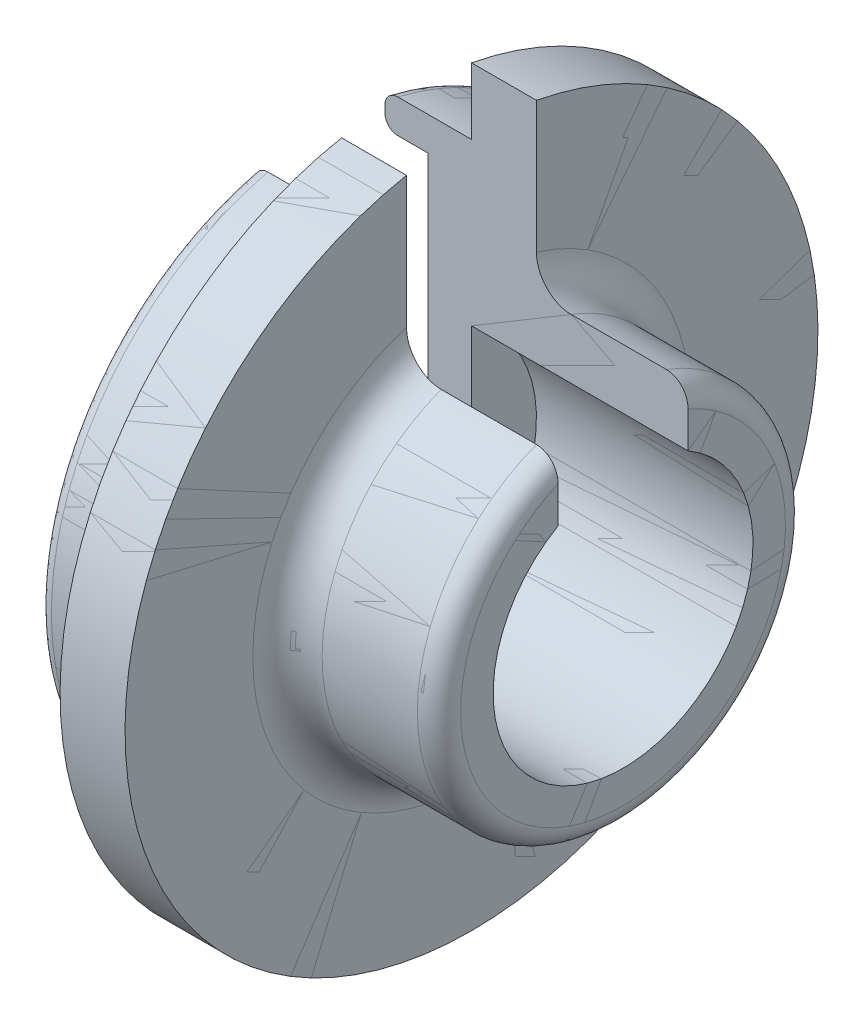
ISO-10303-21;
HEADER;
FILE_DESCRIPTION(('STEP AP214'),'2;1');
FILE_NAME('part.step','',(''),(''),'','','');
FILE_SCHEMA(('AUTOMOTIVE_DESIGN { 1 0 10303 214 1 1 1 1 }'));
ENDSEC;
DATA;
#1=APPLICATION_CONTEXT('core data for automotive mechanical design processes');
#2=APPLICATION_PROTOCOL_DEFINITION('international standard','automotive_design',2000,#1);
#3=PRODUCT_CONTEXT('',#1,'mechanical');
#4=PRODUCT('Part','Part','',(#3));
#5=PRODUCT_RELATED_PRODUCT_CATEGORY('part','',(#4));
#6=PRODUCT_DEFINITION_FORMATION('','',#4);
#7=PRODUCT_DEFINITION_CONTEXT('part definition',#1,'design');
#8=PRODUCT_DEFINITION('design','',#6,#7);
#9=PRODUCT_DEFINITION_SHAPE('','',#8);
#10=(LENGTH_UNIT() NAMED_UNIT(*) SI_UNIT(.MILLI.,.METRE.));
#11=(NAMED_UNIT(*) PLANE_ANGLE_UNIT() SI_UNIT($,.RADIAN.));
#12=(NAMED_UNIT(*) SI_UNIT($,.STERADIAN.) SOLID_ANGLE_UNIT());
#13=UNCERTAINTY_MEASURE_WITH_UNIT(LENGTH_MEASURE(1.E-05),#10,'distance_accuracy_value','');
#14=(GEOMETRIC_REPRESENTATION_CONTEXT(3) GLOBAL_UNCERTAINTY_ASSIGNED_CONTEXT((#13)) GLOBAL_UNIT_ASSIGNED_CONTEXT((#10,
#11,#12)) REPRESENTATION_CONTEXT('',''));
#15=CARTESIAN_POINT('',(0.,0.,0.));
#16=DIRECTION('',(0.,0.,1.));
#17=DIRECTION('',(1.,0.,0.));
#18=AXIS2_PLACEMENT_3D('',#15,#16,#17);
#19=CARTESIAN_POINT('',(-20.,9.2659053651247,3.6442685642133));
#20=CARTESIAN_POINT('',(-20.,9.5086104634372,3.8206041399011));
#21=CARTESIAN_POINT('',(-19.7,9.5086104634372,3.8206041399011));
#22=CARTESIAN_POINT('',(-19.4,9.5086104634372,3.8206041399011));
#23=CARTESIAN_POINT('',(-19.4,9.2659053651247,3.6442685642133));
#24=CARTESIAN_POINT('',(-19.4,9.0232002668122,3.4679329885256));
#25=CARTESIAN_POINT('',(-19.7,9.0232002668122,3.4679329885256));
#26=CARTESIAN_POINT('',(-20.,9.0232002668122,3.4679329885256));
#27=CARTESIAN_POINT('',(-20.,9.2659053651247,3.6442685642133));
#28=(BOUNDED_CURVE() B_SPLINE_CURVE(2,(#19,#20,#21,#22,#23,#24,#25,#26,#27),.UNSPECIFIED.,.T.,
.F.) B_SPLINE_CURVE_WITH_KNOTS((3,2,2,2,3),(0.,0.25,0.5,0.75,1.),
.UNSPECIFIED.) CURVE() GEOMETRIC_REPRESENTATION_ITEM() RATIONAL_B_SPLINE_CURVE((1.,
0.70710678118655,1.,0.70710678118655,1.,0.70710678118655,1.,0.70710678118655,1.)) REPRESENTATION_ITEM(''));
#29=CARTESIAN_POINT('',(-19.4,4.25,0.));
#30=DIRECTION('',(-1.,0.,0.));
#31=AXIS1_PLACEMENT('',#29,#30);
#32=SURFACE_OF_REVOLUTION('',#28,#31);
#33=CARTESIAN_POINT('',(-20.,4.25,0.));
#34=DIRECTION('',(1.,0.,0.));
#35=DIRECTION('',(0.,0.809016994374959,0.587785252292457));
#36=AXIS2_PLACEMENT_3D('',#33,#34,#35);
#37=CIRCLE('',#36,6.2);
#38=CARTESIAN_POINT('',(-20.0000000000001,10.265812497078,-1.50000000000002));
#39=VERTEX_POINT('',#38);
#40=CARTESIAN_POINT('',(-20.,9.2659053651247,3.64426856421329));
#41=VERTEX_POINT('',#40);
#42=EDGE_CURVE('P0_E718',#39,#41,#37,.F.);
#43=ORIENTED_EDGE('',*,*,#42,.F.);
#44=CARTESIAN_POINT('',(-20.,10.265812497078,-1.49999999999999));
#45=CARTESIAN_POINT('',(-20.0000166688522,10.281121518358,-1.50000000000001));
#46=CARTESIAN_POINT('',(-19.9988995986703,10.2964642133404,-1.50000000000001));
#47=CARTESIAN_POINT('',(-19.9937291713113,10.3318926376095,-1.5));
#48=CARTESIAN_POINT('',(-19.9888233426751,10.3518600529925,-1.49999999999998));
#49=CARTESIAN_POINT('',(-19.9815287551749,10.3725843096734,-1.5));
#50=CARTESIAN_POINT('',(-19.9810010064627,10.3740486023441,-1.5));
#51=CARTESIAN_POINT('',(-19.9768334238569,10.3853477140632,-1.50000000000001));
#52=CARTESIAN_POINT('',(-19.972707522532,10.3950152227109,-1.5));
#53=CARTESIAN_POINT('',(-19.9675082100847,10.4056754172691,-1.5));
#54=CARTESIAN_POINT('',(-19.9668977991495,10.40690620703,-1.5));
#55=CARTESIAN_POINT('',(-19.9623836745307,10.4158588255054,-1.5));
#56=CARTESIAN_POINT('',(-19.958163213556,10.423428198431,-1.5));
#57=CARTESIAN_POINT('',(-19.9530878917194,10.4316964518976,-1.5));
#58=CARTESIAN_POINT('',(-19.9525343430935,10.4325880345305,-1.5));
#59=CARTESIAN_POINT('',(-19.9459104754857,10.4431364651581,-1.50000000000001));
#60=CARTESIAN_POINT('',(-19.9393010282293,10.4524734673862,-1.50000000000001));
#61=CARTESIAN_POINT('',(-19.9318888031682,10.4617948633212,-1.5));
#62=CARTESIAN_POINT('',(-19.9315745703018,10.4621880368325,-1.5));
#63=CARTESIAN_POINT('',(-19.9251567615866,10.4701776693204,-1.5));
#64=CARTESIAN_POINT('',(-19.9186890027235,10.4774873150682,-1.50000000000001));
#65=CARTESIAN_POINT('',(-19.903540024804,10.493031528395,-1.49999999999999));
#66=CARTESIAN_POINT('',(-19.8946887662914,10.5011022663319,-1.49999999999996));
#67=CARTESIAN_POINT('',(-19.8849094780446,10.5090073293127,-1.5));
#68=CARTESIAN_POINT('',(-19.8844187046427,10.5094015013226,-1.5));
#69=CARTESIAN_POINT('',(-19.8767781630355,10.5154987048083,-1.50000000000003));
#70=CARTESIAN_POINT('',(-19.8693622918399,10.5208822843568,-1.5));
#71=CARTESIAN_POINT('',(-19.8608231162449,10.5265017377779,-1.5));
#72=CARTESIAN_POINT('',(-19.859920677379,10.5270886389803,-1.5));
#73=CARTESIAN_POINT('',(-19.8498444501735,10.5335642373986,-1.50000000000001));
#74=CARTESIAN_POINT('',(-19.8403382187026,10.5389621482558,-1.50000000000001));
#75=CARTESIAN_POINT('',(-19.8292637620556,10.5444662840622,-1.5));
#76=CARTESIAN_POINT('',(-19.8279467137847,10.5451087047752,-1.5));
#77=CARTESIAN_POINT('',(-19.8191098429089,10.549338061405,-1.49999999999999));
#78=CARTESIAN_POINT('',(-19.8114371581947,10.5526199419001,-1.5));
#79=CARTESIAN_POINT('',(-19.8021526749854,10.5561335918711,-1.5));
#80=CARTESIAN_POINT('',(-19.8006558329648,10.5566861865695,-1.5));
#81=CARTESIAN_POINT('',(-19.7893713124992,10.560747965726,-1.49999999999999));
#82=CARTESIAN_POINT('',(-19.7793899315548,10.563754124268,-1.49999999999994));
#83=CARTESIAN_POINT('',(-19.7678760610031,10.5665635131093,-1.49999999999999));
#84=CARTESIAN_POINT('',(-19.7664608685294,10.5668976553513,-1.5));
#85=CARTESIAN_POINT('',(-19.7568978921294,10.5690804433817,-1.50000000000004));
#86=CARTESIAN_POINT('',(-19.7486669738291,10.5705922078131,-1.49999999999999));
#87=CARTESIAN_POINT('',(-19.7393565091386,10.5718925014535,-1.5));
#88=CARTESIAN_POINT('',(-19.7383200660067,10.57203157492,-1.5));
#89=CARTESIAN_POINT('',(-19.7249324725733,10.5737547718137,-1.50000000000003));
#90=CARTESIAN_POINT('',(-19.7124887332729,10.5745528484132,-1.50000000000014));
#91=CARTESIAN_POINT('',(-19.7000000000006,10.5745553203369,-1.49999999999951));
#92=B_SPLINE_CURVE_WITH_KNOTS('',3,(#44,#45,#46,#47,#48,#49,#50,#51,#52,#53,#54,#55,#56,#57,#58,
#59,#60,#61,#62,#63,#64,#65,#66,#67,#68,#69,#70,#71,#72,#73,#74,#75,#76,#77,#78,#79,#80,#81,#82,
#83,#84,#85,#86,#87,#88,#89,#90,#91),.UNSPECIFIED.,.F.,.F.,(4,2,2,2,2,2,2,2,2,2,2,2,2,2,2,2,2,2,
2,2,2,2,2,4),(0.,0.0459616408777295,0.107198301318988,0.111868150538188,0.143325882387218,
0.147447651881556,0.173403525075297,0.176552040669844,0.210768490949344,0.212278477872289,
0.241512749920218,0.27734799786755,0.279236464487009,0.306672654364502,0.309902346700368,
0.342603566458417,0.346999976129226,0.371992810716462,0.376779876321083,0.407969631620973,
0.412332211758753,0.437395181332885,0.440532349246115,0.477891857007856),.UNSPECIFIED.);
#93=CARTESIAN_POINT('',(-19.7000000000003,10.5745553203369,-1.49999999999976));
#94=VERTEX_POINT('',#93);
#95=EDGE_CURVE('P0_E459',#39,#94,#92,.T.);
#96=ORIENTED_EDGE('',*,*,#95,.T.);
#97=CARTESIAN_POINT('',(-19.7,4.25,0.));
#98=DIRECTION('',(-1.,0.,0.));
#99=DIRECTION('',(0.,0.809016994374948,0.587785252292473));
#100=AXIS2_PLACEMENT_3D('',#97,#98,#99);
#101=CIRCLE('',#100,6.50000000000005);
#102=CARTESIAN_POINT('',(-19.7,10.5745553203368,1.5));
#103=VERTEX_POINT('',#102);
#104=EDGE_CURVE('P0_E452',#94,#103,#101,.T.);
#105=ORIENTED_EDGE('',*,*,#104,.T.);
#106=CARTESIAN_POINT('',(-19.7000000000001,10.5745553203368,1.5));
#107=CARTESIAN_POINT('',(-19.7118226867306,10.574552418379,1.49999999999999));
#108=CARTESIAN_POINT('',(-19.7236018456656,10.5738380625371,1.5));
#109=CARTESIAN_POINT('',(-19.7363024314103,10.5722913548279,1.5));
#110=CARTESIAN_POINT('',(-19.7373001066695,10.5721646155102,1.5));
#111=CARTESIAN_POINT('',(-19.7481126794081,10.5707341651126,1.5));
#112=CARTESIAN_POINT('',(-19.757871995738,10.5689344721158,1.49999999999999));
#113=CARTESIAN_POINT('',(-19.7689416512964,10.5663071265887,1.5));
#114=CARTESIAN_POINT('',(-19.7703753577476,10.5659553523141,1.5));
#115=CARTESIAN_POINT('',(-19.7792796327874,10.5636990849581,1.50000000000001));
#116=CARTESIAN_POINT('',(-19.7866828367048,10.561509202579,1.5));
#117=CARTESIAN_POINT('',(-19.7954962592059,10.5585208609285,1.5));
#118=CARTESIAN_POINT('',(-19.7970042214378,10.5579958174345,1.5));
#119=CARTESIAN_POINT('',(-19.8078493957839,10.5541203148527,1.5));
#120=CARTESIAN_POINT('',(-19.8170313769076,10.5503057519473,1.5));
#121=CARTESIAN_POINT('',(-19.8273175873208,10.5454127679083,1.5));
#122=CARTESIAN_POINT('',(-19.8286409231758,10.5447711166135,1.5));
#123=CARTESIAN_POINT('',(-19.8372456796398,10.5405193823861,1.5));
#124=CARTESIAN_POINT('',(-19.8443887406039,10.5366165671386,1.50000000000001));
#125=CARTESIAN_POINT('',(-19.8523748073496,10.5318189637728,1.5));
#126=CARTESIAN_POINT('',(-19.8533906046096,10.5312004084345,1.5));
#127=CARTESIAN_POINT('',(-19.8635376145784,10.5249378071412,1.49999999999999));
#128=CARTESIAN_POINT('',(-19.8723788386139,10.5187984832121,1.5));
#129=CARTESIAN_POINT('',(-19.8814010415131,10.5117886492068,1.5));
#130=CARTESIAN_POINT('',(-19.8819451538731,10.511362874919,1.5));
#131=CARTESIAN_POINT('',(-19.8897440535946,10.5052166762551,1.5));
#132=CARTESIAN_POINT('',(-19.8967402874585,10.4991607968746,1.5));
#133=CARTESIAN_POINT('',(-19.9120957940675,10.484588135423,1.5));
#134=CARTESIAN_POINT('',(-19.9202616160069,10.4758671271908,1.50000000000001));
#135=CARTESIAN_POINT('',(-19.9338409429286,10.4595508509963,1.5));
#136=CARTESIAN_POINT('',(-19.9394647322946,10.4521300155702,1.49999999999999));
#137=CARTESIAN_POINT('',(-19.9452290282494,10.4437640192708,1.5));
#138=CARTESIAN_POINT('',(-19.9457154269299,10.4430517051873,1.5));
#139=CARTESIAN_POINT('',(-19.9522819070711,10.4333480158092,1.50000000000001));
#140=CARTESIAN_POINT('',(-19.9578969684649,10.4240264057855,1.5));
#141=CARTESIAN_POINT('',(-19.9636185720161,10.4132958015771,1.5));
#142=CARTESIAN_POINT('',(-19.9642259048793,10.412139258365,1.5));
#143=CARTESIAN_POINT('',(-19.9686283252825,10.4036259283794,1.5));
#144=CARTESIAN_POINT('',(-19.9721399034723,10.3961163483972,1.50000000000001));
#145=CARTESIAN_POINT('',(-19.9759348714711,10.3870847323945,1.5));
#146=CARTESIAN_POINT('',(-19.9765128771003,10.3856806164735,1.5));
#147=CARTESIAN_POINT('',(-19.980922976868,10.3747420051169,1.49999999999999));
#148=CARTESIAN_POINT('',(-19.9842999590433,10.3650132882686,1.5));
#149=CARTESIAN_POINT('',(-19.9876234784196,10.3536803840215,1.5));
#150=CARTESIAN_POINT('',(-19.9880445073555,10.352204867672,1.5));
#151=CARTESIAN_POINT('',(-19.9906239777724,10.3429084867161,1.5));
#152=CARTESIAN_POINT('',(-19.9924930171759,10.3350022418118,1.50000000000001));
#153=CARTESIAN_POINT('',(-19.9943069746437,10.3257575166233,1.5));
#154=CARTESIAN_POINT('',(-19.9945508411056,10.3244725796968,1.5));
#155=CARTESIAN_POINT('',(-19.9965883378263,10.3133615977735,1.49999999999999));
#156=CARTESIAN_POINT('',(-19.9979268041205,10.3034427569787,1.50000000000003));
#157=CARTESIAN_POINT('',(-19.9988591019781,10.2927582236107,1.50000000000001));
#158=CARTESIAN_POINT('',(-19.9989205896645,10.2920240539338,1.5));
#159=CARTESIAN_POINT('',(-19.9996593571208,10.2828181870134,1.49999999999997));
#160=CARTESIAN_POINT('',(-19.9999988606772,10.2743241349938,1.49999999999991));
#161=CARTESIAN_POINT('',(-20.,10.2658124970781,1.50000000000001));
#162=B_SPLINE_CURVE_WITH_KNOTS('',3,(#106,#107,#108,#109,#110,#111,#112,#113,#114,#115,#116,
#117,#118,#119,#120,#121,#122,#123,#124,#125,#126,#127,#128,#129,#130,#131,#132,#133,#134,#135,
#136,#137,#138,#139,#140,#141,#142,#143,#144,#145,#146,#147,#148,#149,#150,#151,#152,#153,#154,
#155,#156,#157,#158,#159,#160,#161),.UNSPECIFIED.,.F.,.F.,(4,2,2,2,2,2,2,2,2,2,2,2,2,2,2,2,2,2,
2,2,2,2,2,2,2,2,2,4),(0.,0.0353691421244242,0.0383862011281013,0.0680863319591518,
0.0725152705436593,0.09564229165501,0.100432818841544,0.130190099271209,0.134602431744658,
0.158982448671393,0.162550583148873,0.194752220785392,0.196824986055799,0.224541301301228,
0.260298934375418,0.288189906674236,0.290777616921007,0.323338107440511,0.327257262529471,
0.352090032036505,0.356645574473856,0.387470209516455,0.392073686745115,0.416411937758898,
0.420335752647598,0.450298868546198,0.452509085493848,0.478006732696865),.UNSPECIFIED.);
#163=CARTESIAN_POINT('',(-20.0000000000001,10.2658124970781,1.5));
#164=VERTEX_POINT('',#163);
#165=EDGE_CURVE('P0_E473',#103,#164,#162,.T.);
#166=ORIENTED_EDGE('',*,*,#165,.T.);
#167=CARTESIAN_POINT('',(-20.,4.25,0.));
#168=DIRECTION('',(1.,0.,0.));
#169=DIRECTION('',(0.,0.97029233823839,0.241935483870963));
#170=AXIS2_PLACEMENT_3D('',#167,#168,#169);
#171=CIRCLE('',#170,6.2);
#172=EDGE_CURVE('P0_E488',#41,#164,#171,.F.);
#173=ORIENTED_EDGE('',*,*,#172,.F.);
#174=EDGE_LOOP('',(#43,#96,#105,#166,#173));
#175=FACE_BOUND('',#174,.T.);
#176=ADVANCED_FACE('P0_F350',(#175),#32,.F.);
#177=CARTESIAN_POINT('',(-13.5,7.6883222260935,2.498087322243));
#178=CARTESIAN_POINT('',(-13.,7.6883222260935,2.498087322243));
#179=CARTESIAN_POINT('',(-13.,7.2838137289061,2.2041946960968));
#180=CARTESIAN_POINT('',(-13.,6.8793052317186,1.9103020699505));
#181=CARTESIAN_POINT('',(-13.5,6.8793052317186,1.9103020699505));
#182=CARTESIAN_POINT('',(-14.,6.8793052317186,1.9103020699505));
#183=CARTESIAN_POINT('',(-14.,7.2838137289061,2.2041946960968));
#184=CARTESIAN_POINT('',(-14.,7.6883222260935,2.498087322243));
#185=CARTESIAN_POINT('',(-13.5,7.6883222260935,2.498087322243));
#186=(BOUNDED_CURVE() B_SPLINE_CURVE(2,(#177,#178,#179,#180,#181,#182,#183,#184,#185),
.UNSPECIFIED.,.T.,.F.) B_SPLINE_CURVE_WITH_KNOTS((3,2,2,2,3),(0.,0.25,0.5,0.75,1.),
.UNSPECIFIED.) CURVE() GEOMETRIC_REPRESENTATION_ITEM() RATIONAL_B_SPLINE_CURVE((1.,
0.70710678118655,1.,0.70710678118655,1.,0.70710678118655,1.,0.70710678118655,1.)) REPRESENTATION_ITEM(''));
#187=CARTESIAN_POINT('',(-13.,4.25,0.));
#188=DIRECTION('',(-1.,0.,0.));
#189=AXIS1_PLACEMENT('',#187,#188);
#190=SURFACE_OF_REVOLUTION('',#186,#189);
#191=CARTESIAN_POINT('',(-13.,7.68693177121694,1.50000000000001));
#192=CARTESIAN_POINT('',(-12.9999972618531,7.70722619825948,1.5));
#193=CARTESIAN_POINT('',(-13.0010378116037,7.72752481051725,1.5));
#194=CARTESIAN_POINT('',(-13.0050729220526,7.76661663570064,1.5));
#195=CARTESIAN_POINT('',(-13.007938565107,7.7854232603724,1.5));
#196=CARTESIAN_POINT('',(-13.0149509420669,7.81996023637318,1.5));
#197=CARTESIAN_POINT('',(-13.0188515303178,7.83574108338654,1.5));
#198=CARTESIAN_POINT('',(-13.0290800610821,7.87065719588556,1.5));
#199=CARTESIAN_POINT('',(-13.035765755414,7.88968960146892,1.5));
#200=CARTESIAN_POINT('',(-13.0498626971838,7.92380879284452,1.5));
#201=CARTESIAN_POINT('',(-13.0569666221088,7.93902394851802,1.5));
#202=CARTESIAN_POINT('',(-13.0743222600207,7.97213901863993,1.5));
#203=CARTESIAN_POINT('',(-13.0849223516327,7.9898589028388,1.5));
#204=CARTESIAN_POINT('',(-13.1060725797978,8.0209796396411,1.5));
#205=CARTESIAN_POINT('',(-13.1163096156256,8.03459507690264,1.5));
#206=CARTESIAN_POINT('',(-13.1402477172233,8.06339268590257,1.5));
#207=CARTESIAN_POINT('',(-13.1542318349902,8.07834191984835,1.5));
#208=CARTESIAN_POINT('',(-13.1805684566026,8.10330563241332,1.5));
#209=CARTESIAN_POINT('',(-13.1925849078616,8.11367545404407,1.49999999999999));
#210=CARTESIAN_POINT('',(-13.2060955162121,8.12425945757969,1.5));
#211=CARTESIAN_POINT('',(-13.2071348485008,8.12506705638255,1.5));
#212=CARTESIAN_POINT('',(-13.222615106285,8.1369977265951,1.50000000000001));
#213=CARTESIAN_POINT('',(-13.2376829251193,8.14734821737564,1.5));
#214=CARTESIAN_POINT('',(-13.2550582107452,8.15790858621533,1.5));
#215=CARTESIAN_POINT('',(-13.256863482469,8.15898989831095,1.5));
#216=CARTESIAN_POINT('',(-13.270632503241,8.1671167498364,1.5));
#217=CARTESIAN_POINT('',(-13.2828995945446,8.17366984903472,1.5));
#218=CARTESIAN_POINT('',(-13.2976880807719,8.18076830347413,1.5));
#219=CARTESIAN_POINT('',(-13.2999680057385,8.18184076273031,1.5));
#220=CARTESIAN_POINT('',(-13.3176159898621,8.18997340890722,1.5));
#221=CARTESIAN_POINT('',(-13.3333668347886,8.19624943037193,1.5));
#222=CARTESIAN_POINT('',(-13.3518750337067,8.20250349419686,1.5));
#223=CARTESIAN_POINT('',(-13.3543679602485,8.20332290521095,1.5));
#224=CARTESIAN_POINT('',(-13.3695034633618,8.20815908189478,1.5));
#225=CARTESIAN_POINT('',(-13.3823177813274,8.21166963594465,1.49999999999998));
#226=CARTESIAN_POINT('',(-13.3974945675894,8.21514659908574,1.5));
#227=CARTESIAN_POINT('',(-13.3997450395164,8.2156448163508,1.50000000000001));
#228=CARTESIAN_POINT('',(-13.4186818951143,8.21969119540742,1.49999999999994));
#229=CARTESIAN_POINT('',(-13.4355791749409,8.22235211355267,1.49999999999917));
#230=CARTESIAN_POINT('',(-13.4538720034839,8.22421625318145,1.49999999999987));
#231=CARTESIAN_POINT('',(-13.4551939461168,8.22434527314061,1.49999999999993));
#232=CARTESIAN_POINT('',(-13.4709628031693,8.22581646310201,1.50000000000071));
#233=CARTESIAN_POINT('',(-13.485461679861,8.22649051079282,1.50000000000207));
#234=CARTESIAN_POINT('',(-13.4999999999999,8.2264934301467,1.49999999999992));
#235=B_SPLINE_CURVE_WITH_KNOTS('',3,(#191,#192,#193,#194,#195,#196,#197,#198,#199,#200,#201,
#202,#203,#204,#205,#206,#207,#208,#209,#210,#211,#212,#213,#214,#215,#216,#217,#218,#219,#220,
#221,#222,#223,#224,#225,#226,#227,#228,#229,#230,#231,#232,#233,#234),.UNSPECIFIED.,.F.,.F.,(4,
2,2,2,2,2,2,2,2,2,2,2,2,2,2,2,2,2,2,2,2,4),(0.,0.0608632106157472,0.11784287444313,
0.166556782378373,0.226949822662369,0.277263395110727,0.33906276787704,0.390094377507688,
0.451354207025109,0.498893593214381,0.502842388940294,0.557523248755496,0.563836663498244,
0.605486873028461,0.613046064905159,0.663777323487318,0.671650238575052,0.711443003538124,
0.718358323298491,0.769531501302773,0.773516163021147,0.817046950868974),.UNSPECIFIED.);
#236=CARTESIAN_POINT('',(-13.,7.68693177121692,1.5));
#237=VERTEX_POINT('',#236);
#238=CARTESIAN_POINT('',(-13.5,8.22649343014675,1.49999999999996));
#239=VERTEX_POINT('',#238);
#240=EDGE_CURVE('P0_E505',#237,#239,#235,.T.);
#241=ORIENTED_EDGE('',*,*,#240,.T.);
#242=CARTESIAN_POINT('',(-13.5,4.25,0.));
#243=DIRECTION('',(-1.,0.,0.));
#244=DIRECTION('',(0.,0.809016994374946,0.587785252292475));
#245=AXIS2_PLACEMENT_3D('',#242,#243,#244);
#246=CIRCLE('',#245,4.24999999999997);
#247=CARTESIAN_POINT('',(-13.5,8.22649343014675,-1.5));
#248=VERTEX_POINT('',#247);
#249=EDGE_CURVE('P0_E489',#239,#248,#246,.F.);
#250=ORIENTED_EDGE('',*,*,#249,.T.);
#251=CARTESIAN_POINT('',(-13.5,8.22649343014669,-1.5));
#252=CARTESIAN_POINT('',(-13.4821401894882,8.22649690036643,-1.5));
#253=CARTESIAN_POINT('',(-13.4642912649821,8.2254702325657,-1.5));
#254=CARTESIAN_POINT('',(-13.4322463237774,8.22178708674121,-1.5));
#255=CARTESIAN_POINT('',(-13.4180093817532,8.21948292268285,-1.5));
#256=CARTESIAN_POINT('',(-13.3855037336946,8.21267660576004,-1.5));
#257=CARTESIAN_POINT('',(-13.367328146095,8.20771868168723,-1.5));
#258=CARTESIAN_POINT('',(-13.3345690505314,8.19666111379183,-1.5));
#259=CARTESIAN_POINT('',(-13.3198782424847,8.19087367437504,-1.5));
#260=CARTESIAN_POINT('',(-13.2873132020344,8.17615628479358,-1.5));
#261=CARTESIAN_POINT('',(-13.2696289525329,8.16679996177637,-1.5));
#262=CARTESIAN_POINT('',(-13.2384531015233,8.14778549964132,-1.5));
#263=CARTESIAN_POINT('',(-13.2247610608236,8.13845142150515,-1.5));
#264=CARTESIAN_POINT('',(-13.1950030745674,8.11591666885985,-1.5));
#265=CARTESIAN_POINT('',(-13.1792211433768,8.10233677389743,-1.5));
#266=CARTESIAN_POINT('',(-13.1522748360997,8.0761324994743,-1.5));
#267=CARTESIAN_POINT('',(-13.1408035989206,8.06381907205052,-1.5));
#268=CARTESIAN_POINT('',(-13.1170571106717,8.03572201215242,-1.5));
#269=CARTESIAN_POINT('',(-13.1050352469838,8.01972089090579,-1.49999999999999));
#270=CARTESIAN_POINT('',(-13.0932084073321,8.00199623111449,-1.5));
#271=CARTESIAN_POINT('',(-13.0924655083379,8.00087369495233,-1.5));
#272=CARTESIAN_POINT('',(-13.0834158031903,7.98708673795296,-1.50000000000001));
#273=CARTESIAN_POINT('',(-13.0756354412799,7.97406293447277,-1.49999999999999));
#274=CARTESIAN_POINT('',(-13.0674836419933,7.95903188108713,-1.5));
#275=CARTESIAN_POINT('',(-13.0665616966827,7.95730991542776,-1.5));
#276=CARTESIAN_POINT('',(-13.0561379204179,7.93758762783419,-1.50000000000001));
#277=CARTESIAN_POINT('',(-13.0476231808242,7.91904531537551,-1.5));
#278=CARTESIAN_POINT('',(-13.0337435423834,7.88389452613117,-1.5));
#279=CARTESIAN_POINT('',(-13.028101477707,7.86739280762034,-1.5));
#280=CARTESIAN_POINT('',(-13.0175282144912,7.83113160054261,-1.5));
#281=CARTESIAN_POINT('',(-13.0128748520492,7.81128982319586,-1.5));
#282=CARTESIAN_POINT('',(-13.0064028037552,7.77530685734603,-1.5));
#283=CARTESIAN_POINT('',(-13.004200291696,7.75923278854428,-1.5));
#284=CARTESIAN_POINT('',(-13.000886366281,7.72443222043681,-1.5));
#285=CARTESIAN_POINT('',(-12.9999995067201,7.70568410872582,-1.50000000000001));
#286=CARTESIAN_POINT('',(-13.,7.68693177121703,-1.50000000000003));
#287=B_SPLINE_CURVE_WITH_KNOTS('',3,(#251,#252,#253,#254,#255,#256,#257,#258,#259,#260,#261,
#262,#263,#264,#265,#266,#267,#268,#269,#270,#271,#272,#273,#274,#275,#276,#277,#278,#279,#280,
#281,#282,#283,#284,#285,#286),.UNSPECIFIED.,.F.,.F.,(4,2,2,2,2,2,2,2,2,2,2,2,2,2,2,2,2,4),(0.,
0.0535277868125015,0.0967374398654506,0.15311130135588,0.200411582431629,0.260266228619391,
0.309905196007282,0.372191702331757,0.422610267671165,0.482494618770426,0.486533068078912,
0.531968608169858,0.537828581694,0.598889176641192,0.651143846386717,0.712160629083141,
0.760781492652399,0.817007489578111),.UNSPECIFIED.);
#288=CARTESIAN_POINT('',(-13.,7.68693177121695,-1.49999999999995));
#289=VERTEX_POINT('',#288);
#290=EDGE_CURVE('P0_E522',#248,#289,#287,.T.);
#291=ORIENTED_EDGE('',*,*,#290,.T.);
#292=CARTESIAN_POINT('',(-13.,4.25,0.));
#293=DIRECTION('',(-1.,0.,0.));
#294=DIRECTION('',(0.,0.916515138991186,-0.399999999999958));
#295=AXIS2_PLACEMENT_3D('',#292,#293,#294);
#296=CIRCLE('',#295,3.75000000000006);
#297=CARTESIAN_POINT('',(-13.,7.28381372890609,2.20419469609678));
#298=VERTEX_POINT('',#297);
#299=EDGE_CURVE('P0_E843',#298,#289,#296,.F.);
#300=ORIENTED_EDGE('',*,*,#299,.F.);
#301=CARTESIAN_POINT('',(-13.,4.25,0.));
#302=DIRECTION('',(-1.,0.,0.));
#303=DIRECTION('',(0.,0.809016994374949,0.587785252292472));
#304=AXIS2_PLACEMENT_3D('',#301,#302,#303);
#305=CIRCLE('',#304,3.75000000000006);
#306=EDGE_CURVE('P0_E552',#237,#298,#305,.F.);
#307=ORIENTED_EDGE('',*,*,#306,.F.);
#308=EDGE_LOOP('',(#241,#250,#291,#300,#307));
#309=FACE_BOUND('',#308,.T.);
#310=ADVANCED_FACE('P0_F559',(#309),#190,.F.);
#311=CARTESIAN_POINT('',(-13.5,4.25,0.));
#312=DIRECTION('',(-1.,0.,0.));
#313=DIRECTION('',(0.,0.,1.));
#314=AXIS2_PLACEMENT_3D('',#311,#312,#313);
#315=CYLINDRICAL_SURFACE('',#314,4.24999999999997);
#316=ORIENTED_EDGE('',*,*,#249,.F.);
#317=DIRECTION('',(-1.,0.,0.));
#318=VECTOR('',#317,1.);
#319=CARTESIAN_POINT('',(-16.9290584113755,8.2264934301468,1.5));
#320=LINE('',#319,#318);
#321=CARTESIAN_POINT('',(-15.7,8.22649343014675,1.5));
#322=VERTEX_POINT('',#321);
#323=EDGE_CURVE('P0_E502',#239,#322,#320,.T.);
#324=ORIENTED_EDGE('',*,*,#323,.T.);
#325=CARTESIAN_POINT('',(-15.7,4.25,0.));
#326=DIRECTION('',(-1.,0.,0.));
#327=DIRECTION('',(0.,0.809016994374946,0.587785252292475));
#328=AXIS2_PLACEMENT_3D('',#325,#326,#327);
#329=CIRCLE('',#328,4.24999999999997);
#330=CARTESIAN_POINT('',(-15.7,8.22649343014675,-1.5));
#331=VERTEX_POINT('',#330);
#332=EDGE_CURVE('P0_E506',#322,#331,#329,.F.);
#333=ORIENTED_EDGE('',*,*,#332,.T.);
#334=DIRECTION('',(1.,0.,0.));
#335=VECTOR('',#334,1.);
#336=CARTESIAN_POINT('',(-16.9290584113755,8.2264934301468,-1.5));
#337=LINE('',#336,#335);
#338=EDGE_CURVE('P0_E528',#331,#248,#337,.T.);
#339=ORIENTED_EDGE('',*,*,#338,.T.);
#340=EDGE_LOOP('',(#316,#324,#333,#339));
#341=FACE_BOUND('',#340,.T.);
#342=ADVANCED_FACE('P0_F570',(#341),#315,.T.);
#343=CARTESIAN_POINT('',(-18.,4.25,0.));
#344=DIRECTION('',(-1.,0.,0.));
#345=DIRECTION('',(0.,0.,1.));
#346=AXIS2_PLACEMENT_3D('',#343,#344,#345);
#347=CYLINDRICAL_SURFACE('',#346,6.50000000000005);
#348=CARTESIAN_POINT('',(-18.,4.25,0.));
#349=DIRECTION('',(-1.,0.,0.));
#350=DIRECTION('',(0.,0.,1.));
#351=AXIS2_PLACEMENT_3D('',#348,#349,#350);
#352=CIRCLE('',#351,6.50000000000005);
#353=CARTESIAN_POINT('',(-18.0000000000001,10.5745553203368,1.5));
#354=VERTEX_POINT('',#353);
#355=CARTESIAN_POINT('',(-18.,10.5745553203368,-1.50000000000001));
#356=VERTEX_POINT('',#355);
#357=EDGE_CURVE('P0_E492',#354,#356,#352,.F.);
#358=ORIENTED_EDGE('',*,*,#357,.F.);
#359=DIRECTION('',(-1.,0.,0.));
#360=VECTOR('',#359,1.);
#361=CARTESIAN_POINT('',(-16.9290584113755,10.5745553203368,1.5));
#362=LINE('',#361,#360);
#363=EDGE_CURVE('P0_E482',#354,#103,#362,.T.);
#364=ORIENTED_EDGE('',*,*,#363,.T.);
#365=ORIENTED_EDGE('',*,*,#104,.F.);
#366=DIRECTION('',(1.,0.,0.));
#367=VECTOR('',#366,1.);
#368=CARTESIAN_POINT('',(-16.9290584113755,10.5745553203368,-1.5));
#369=LINE('',#368,#367);
#370=EDGE_CURVE('P0_E515',#94,#356,#369,.T.);
#371=ORIENTED_EDGE('',*,*,#370,.T.);
#372=EDGE_LOOP('',(#358,#364,#365,#371));
#373=FACE_BOUND('',#372,.T.);
#374=ADVANCED_FACE('P0_F491',(#373),#347,.T.);
#375=CARTESIAN_POINT('',(-20.,-7.6882614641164,1.01852833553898));
#376=DIRECTION('',(-1.,0.,0.));
#377=DIRECTION('',(0.,0.809016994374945,0.587785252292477));
#378=AXIS2_PLACEMENT_3D('',#375,#376,#377);
#379=PLANE('',#378);
#380=DIRECTION('',(0.,1.,0.));
#381=VECTOR('',#380,1.);
#382=CARTESIAN_POINT('',(-20.0000000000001,8.1790584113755,-1.5));
#383=LINE('',#382,#381);
#384=CARTESIAN_POINT('',(-20.0000000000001,10.1111005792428,-1.49999999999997));
#385=VERTEX_POINT('',#384);
#386=EDGE_CURVE('P0_E518',#385,#39,#383,.T.);
#387=ORIENTED_EDGE('',*,*,#386,.T.);
#388=ORIENTED_EDGE('',*,*,#42,.T.);
#389=ORIENTED_EDGE('',*,*,#172,.T.);
#390=DIRECTION('',(0.,-1.,0.));
#391=VECTOR('',#390,1.);
#392=CARTESIAN_POINT('',(-20.0000000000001,8.1790584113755,1.5));
#393=LINE('',#392,#391);
#394=CARTESIAN_POINT('',(-20.0000000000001,10.1111005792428,1.50000000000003));
#395=VERTEX_POINT('',#394);
#396=EDGE_CURVE('P0_E486',#164,#395,#393,.T.);
#397=ORIENTED_EDGE('',*,*,#396,.T.);
#398=CARTESIAN_POINT('',(-20.,4.25,0.));
#399=DIRECTION('',(-1.,0.,0.));
#400=DIRECTION('',(0.,0.809016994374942,0.58778525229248));
#401=AXIS2_PLACEMENT_3D('',#398,#399,#400);
#402=CIRCLE('',#401,6.05);
#403=CARTESIAN_POINT('',(-20.,9.14455281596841,3.55610077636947));
#404=VERTEX_POINT('',#403);
#405=EDGE_CURVE('P0_E712',#404,#395,#402,.T.);
#406=ORIENTED_EDGE('',*,*,#405,.F.);
#407=CARTESIAN_POINT('',(-20.,4.25,0.));
#408=DIRECTION('',(-1.,0.,0.));
#409=DIRECTION('',(0.,0.968776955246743,-0.24793388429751));
#410=AXIS2_PLACEMENT_3D('',#407,#408,#409);
#411=CIRCLE('',#410,6.05);
#412=EDGE_CURVE('P0_E721',#404,#385,#411,.F.);
#413=ORIENTED_EDGE('',*,*,#412,.T.);
#414=EDGE_LOOP('',(#387,#388,#389,#397,#406,#413));
#415=FACE_BOUND('',#414,.T.);
#416=ADVANCED_FACE('P0_F605',(#415),#379,.T.);
#417=CARTESIAN_POINT('',(-19.7,9.3872579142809,3.7324363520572));
#418=CARTESIAN_POINT('',(-19.4,9.3872579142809,3.7324363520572));
#419=CARTESIAN_POINT('',(-19.4,9.1445528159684,3.5561007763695));
#420=CARTESIAN_POINT('',(-19.4,8.9018477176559,3.3797652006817));
#421=CARTESIAN_POINT('',(-19.7,8.9018477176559,3.3797652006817));
#422=CARTESIAN_POINT('',(-20.,8.9018477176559,3.3797652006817));
#423=CARTESIAN_POINT('',(-20.,9.1445528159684,3.5561007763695));
#424=CARTESIAN_POINT('',(-20.,9.3872579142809,3.7324363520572));
#425=CARTESIAN_POINT('',(-19.7,9.3872579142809,3.7324363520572));
#426=(BOUNDED_CURVE() B_SPLINE_CURVE(2,(#417,#418,#419,#420,#421,#422,#423,#424,#425),
.UNSPECIFIED.,.T.,.F.) B_SPLINE_CURVE_WITH_KNOTS((3,2,2,2,3),(0.,0.25,0.5,0.75,1.),
.UNSPECIFIED.) CURVE() GEOMETRIC_REPRESENTATION_ITEM() RATIONAL_B_SPLINE_CURVE((1.,
0.70710678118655,1.,0.70710678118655,1.,0.70710678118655,1.,0.70710678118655,1.)) REPRESENTATION_ITEM(''));
#427=CARTESIAN_POINT('',(-19.4,4.25,0.));
#428=DIRECTION('',(-1.,0.,0.));
#429=AXIS1_PLACEMENT('',#427,#428);
#430=SURFACE_OF_REVOLUTION('',#426,#429);
#431=CARTESIAN_POINT('',(-20.,10.1111005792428,1.5));
#432=CARTESIAN_POINT('',(-20.0000116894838,10.0874168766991,1.49999999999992));
#433=CARTESIAN_POINT('',(-19.9973630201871,10.063795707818,1.49999999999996));
#434=CARTESIAN_POINT('',(-19.9903789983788,10.0328509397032,1.49999999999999));
#435=CARTESIAN_POINT('',(-19.9882888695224,10.0249981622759,1.5));
#436=CARTESIAN_POINT('',(-19.9854447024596,10.0157532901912,1.5));
#437=CARTESIAN_POINT('',(-19.9849769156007,10.0142715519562,1.5));
#438=CARTESIAN_POINT('',(-19.9816041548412,10.0038554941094,1.5));
#439=CARTESIAN_POINT('',(-19.9783107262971,9.99503952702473,1.5));
#440=CARTESIAN_POINT('',(-19.9740543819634,9.98503161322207,1.5));
#441=CARTESIAN_POINT('',(-19.9734651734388,9.98367286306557,1.5));
#442=CARTESIAN_POINT('',(-19.9697800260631,9.97533612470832,1.5));
#443=CARTESIAN_POINT('',(-19.9664384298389,9.96846223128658,1.49999999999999));
#444=CARTESIAN_POINT('',(-19.9622606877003,9.96061015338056,1.5));
#445=CARTESIAN_POINT('',(-19.9616619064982,9.95950092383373,1.5));
#446=CARTESIAN_POINT('',(-19.9562954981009,9.9497018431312,1.50000000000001));
#447=CARTESIAN_POINT('',(-19.9511170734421,9.94122596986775,1.50000000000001));
#448=CARTESIAN_POINT('',(-19.9450773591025,9.93232619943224,1.5));
#449=CARTESIAN_POINT('',(-19.9446004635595,9.93162960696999,1.5));
#450=CARTESIAN_POINT('',(-19.9393606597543,9.92404251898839,1.5));
#451=CARTESIAN_POINT('',(-19.9343180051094,9.91733754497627,1.50000000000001));
#452=CARTESIAN_POINT('',(-19.9287484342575,9.91052819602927,1.5));
#453=CARTESIAN_POINT('',(-19.9284813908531,9.91020307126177,1.5));
#454=CARTESIAN_POINT('',(-19.9214109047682,9.90163067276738,1.5));
#455=CARTESIAN_POINT('',(-19.9141728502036,9.89373066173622,1.5));
#456=CARTESIAN_POINT('',(-19.9003870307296,9.88018836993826,1.5));
#457=CARTESIAN_POINT('',(-19.8939766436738,9.87440498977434,1.50000000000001));
#458=CARTESIAN_POINT('',(-19.8868813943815,9.86853383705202,1.5));
#459=CARTESIAN_POINT('',(-19.8864283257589,9.86816115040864,1.5));
#460=CARTESIAN_POINT('',(-19.8783019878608,9.86151624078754,1.49999999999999));
#461=CARTESIAN_POINT('',(-19.870312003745,9.85561408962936,1.49999999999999));
#462=CARTESIAN_POINT('',(-19.8611675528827,9.84953714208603,1.5));
#463=CARTESIAN_POINT('',(-19.8602742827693,9.84895040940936,1.5));
#464=CARTESIAN_POINT('',(-19.8530720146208,9.84427486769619,1.50000000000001));
#465=CARTESIAN_POINT('',(-19.8466076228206,9.8404169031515,1.50000000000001));
#466=CARTESIAN_POINT('',(-19.8388063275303,9.83615431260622,1.5));
#467=CARTESIAN_POINT('',(-19.8375980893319,9.83550498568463,1.5));
#468=CARTESIAN_POINT('',(-19.8284134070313,9.83065100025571,1.5));
#469=CARTESIAN_POINT('',(-19.8202421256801,9.82679867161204,1.5));
#470=CARTESIAN_POINT('',(-19.8104638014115,9.82272686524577,1.5));
#471=CARTESIAN_POINT('',(-19.8090046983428,9.82213300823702,1.5));
#472=CARTESIAN_POINT('',(-19.8011093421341,9.81899342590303,1.5));
#473=CARTESIAN_POINT('',(-19.79458422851,9.81666208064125,1.5));
#474=CARTESIAN_POINT('',(-19.7864874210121,9.81408934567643,1.5));
#475=CARTESIAN_POINT('',(-19.7849831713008,9.81362472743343,1.5));
#476=CARTESIAN_POINT('',(-19.7751059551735,9.81066133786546,1.5));
#477=CARTESIAN_POINT('',(-19.7666172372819,9.80852437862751,1.50000000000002));
#478=CARTESIAN_POINT('',(-19.7567557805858,9.80650946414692,1.5));
#479=CARTESIAN_POINT('',(-19.7554533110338,9.80625263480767,1.5));
#480=CARTESIAN_POINT('',(-19.7471674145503,9.80467771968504,1.49999999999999));
#481=CARTESIAN_POINT('',(-19.7401333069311,9.80360624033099,1.50000000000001));
#482=CARTESIAN_POINT('',(-19.7321799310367,9.80269239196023,1.5));
#483=CARTESIAN_POINT('',(-19.73128646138,9.80259394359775,1.5));
#484=CARTESIAN_POINT('',(-19.7203041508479,9.80143555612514,1.49999999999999));
#485=CARTESIAN_POINT('',(-19.7101645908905,9.8009019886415,1.49999999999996));
#486=CARTESIAN_POINT('',(-19.7000000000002,9.80090082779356,1.5000000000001));
#487=B_SPLINE_CURVE_WITH_KNOTS('',3,(#431,#432,#433,#434,#435,#436,#437,#438,#439,#440,#441,
#442,#443,#444,#445,#446,#447,#448,#449,#450,#451,#452,#453,#454,#455,#456,#457,#458,#459,#460,
#461,#462,#463,#464,#465,#466,#467,#468,#469,#470,#471,#472,#473,#474,#475,#476,#477,#478,#479,
#480,#481,#482,#483,#484,#485,#486),.UNSPECIFIED.,.F.,.F.,(4,2,2,2,2,2,2,2,2,2,2,2,2,2,2,2,2,2,
2,2,2,2,2,2,2,2,2,4),(0.,0.0707605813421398,0.0951167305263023,0.0997782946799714,
0.127959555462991,0.132402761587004,0.155303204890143,0.159084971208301,0.188818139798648,
0.191350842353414,0.216479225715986,0.217741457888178,0.249815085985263,0.275683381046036,
0.277443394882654,0.307173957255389,0.310380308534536,0.332933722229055,0.337048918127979,
0.364097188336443,0.368823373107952,0.389586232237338,0.394309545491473,0.420520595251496,
0.424503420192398,0.445822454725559,0.448519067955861,0.478953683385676),.UNSPECIFIED.);
#488=CARTESIAN_POINT('',(-19.7000000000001,9.80090082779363,1.50000000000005));
#489=VERTEX_POINT('',#488);
#490=EDGE_CURVE('P0_E495',#395,#489,#487,.T.);
#491=ORIENTED_EDGE('',*,*,#490,.T.);
#492=CARTESIAN_POINT('',(-19.7,4.25,0.));
#493=DIRECTION('',(-1.,0.,0.));
#494=DIRECTION('',(0.,0.809016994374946,0.587785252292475));
#495=AXIS2_PLACEMENT_3D('',#492,#493,#494);
#496=CIRCLE('',#495,5.74999999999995);
#497=CARTESIAN_POINT('',(-19.7,9.80090082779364,-1.5));
#498=VERTEX_POINT('',#497);
#499=EDGE_CURVE('P0_E708',#498,#489,#496,.T.);
#500=ORIENTED_EDGE('',*,*,#499,.F.);
#501=CARTESIAN_POINT('',(-19.7000000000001,9.80090082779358,-1.5));
#502=CARTESIAN_POINT('',(-19.7195493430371,9.80090432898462,-1.50000000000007));
#503=CARTESIAN_POINT('',(-19.7389684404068,9.80287869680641,-1.50000000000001));
#504=CARTESIAN_POINT('',(-19.7593540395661,9.80704009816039,-1.5));
#505=CARTESIAN_POINT('',(-19.7606961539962,9.80732398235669,-1.5));
#506=CARTESIAN_POINT('',(-19.7685434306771,9.80904195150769,-1.5));
#507=CARTESIAN_POINT('',(-19.7750041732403,9.81069069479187,-1.5));
#508=CARTESIAN_POINT('',(-19.7829014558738,9.81299640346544,-1.5));
#509=CARTESIAN_POINT('',(-19.7844010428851,9.81344735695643,-1.5));
#510=CARTESIAN_POINT('',(-19.7940748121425,9.8164415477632,-1.49999999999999));
#511=CARTESIAN_POINT('',(-19.8021473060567,9.81933431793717,-1.5));
#512=CARTESIAN_POINT('',(-19.8115225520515,9.82316354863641,-1.5));
#513=CARTESIAN_POINT('',(-19.8129679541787,9.8237674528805,-1.5));
#514=CARTESIAN_POINT('',(-19.8207338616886,9.82708524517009,-1.5));
#515=CARTESIAN_POINT('',(-19.8269674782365,9.83001072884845,-1.5));
#516=CARTESIAN_POINT('',(-19.8343390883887,9.83378902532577,-1.5));
#517=CARTESIAN_POINT('',(-19.8355849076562,9.83443881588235,-1.5));
#518=CARTESIAN_POINT('',(-19.8449323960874,9.83939925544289,-1.5));
#519=CARTESIAN_POINT('',(-19.852845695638,9.84408177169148,-1.50000000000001));
#520=CARTESIAN_POINT('',(-19.8613990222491,9.84969000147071,-1.5));
#521=CARTESIAN_POINT('',(-19.8622750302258,9.85027102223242,-1.5));
#522=CARTESIAN_POINT('',(-19.8695385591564,9.85514398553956,-1.49999999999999));
#523=CARTESIAN_POINT('',(-19.875767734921,9.8596807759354,-1.50000000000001));
#524=CARTESIAN_POINT('',(-19.8823367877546,9.86486113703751,-1.5));
#525=CARTESIAN_POINT('',(-19.8828618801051,9.86527807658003,-1.5));
#526=CARTESIAN_POINT('',(-19.8914145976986,9.87211588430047,-1.49999999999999));
#527=CARTESIAN_POINT('',(-19.8991215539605,9.8789511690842,-1.5));
#528=CARTESIAN_POINT('',(-19.9126639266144,9.89224344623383,-1.5));
#529=CARTESIAN_POINT('',(-19.9186043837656,9.89859523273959,-1.5));
#530=CARTESIAN_POINT('',(-19.9309972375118,9.91302649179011,-1.5));
#531=CARTESIAN_POINT('',(-19.9373350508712,9.92120593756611,-1.49999999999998));
#532=CARTESIAN_POINT('',(-19.943714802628,9.93034671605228,-1.5));
#533=CARTESIAN_POINT('',(-19.9441817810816,9.93102148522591,-1.5));
#534=CARTESIAN_POINT('',(-19.9490333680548,9.93809160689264,-1.50000000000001));
#535=CARTESIAN_POINT('',(-19.9531838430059,9.94465329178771,-1.49999999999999));
#536=CARTESIAN_POINT('',(-19.9576705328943,9.9523667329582,-1.5));
#537=CARTESIAN_POINT('',(-19.9582527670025,9.95338074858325,-1.5));
#538=CARTESIAN_POINT('',(-19.9634865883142,9.96261551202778,-1.50000000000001));
#539=CARTESIAN_POINT('',(-19.9677755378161,9.97105091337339,-1.49999999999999));
#540=CARTESIAN_POINT('',(-19.9722781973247,9.98098745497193,-1.5));
#541=CARTESIAN_POINT('',(-19.9728728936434,9.98232455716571,-1.5));
#542=CARTESIAN_POINT('',(-19.9763474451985,9.9902854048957,-1.50000000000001));
#543=CARTESIAN_POINT('',(-19.9790106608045,9.99700738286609,-1.50000000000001));
#544=CARTESIAN_POINT('',(-19.9819638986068,10.0052755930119,-1.5));
#545=CARTESIAN_POINT('',(-19.9824768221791,10.0067457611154,-1.5));
#546=CARTESIAN_POINT('',(-19.9859398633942,10.0169120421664,-1.49999999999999));
#547=CARTESIAN_POINT('',(-19.9885252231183,10.0257395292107,-1.5));
#548=CARTESIAN_POINT('',(-19.9910704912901,10.0360654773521,-1.5));
#549=CARTESIAN_POINT('',(-19.9914083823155,10.0374778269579,-1.5));
#550=CARTESIAN_POINT('',(-19.9933943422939,10.0460372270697,-1.5));
#551=CARTESIAN_POINT('',(-19.9948060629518,10.0532425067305,-1.5));
#552=CARTESIAN_POINT('',(-19.9961509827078,10.0616282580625,-1.5));
#553=CARTESIAN_POINT('',(-19.9963281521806,10.0627727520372,-1.5));
#554=CARTESIAN_POINT('',(-19.9988266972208,10.0795153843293,-1.5));
#555=CARTESIAN_POINT('',(-19.9999967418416,10.0952759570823,-1.49999999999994));
#556=CARTESIAN_POINT('',(-20.,10.1111005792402,-1.49999999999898));
#557=B_SPLINE_CURVE_WITH_KNOTS('',3,(#501,#502,#503,#504,#505,#506,#507,#508,#509,#510,#511,
#512,#513,#514,#515,#516,#517,#518,#519,#520,#521,#522,#523,#524,#525,#526,#527,#528,#529,#530,
#531,#532,#533,#534,#535,#536,#537,#538,#539,#540,#541,#542,#543,#544,#545,#546,#547,#548,#549,
#550,#551,#552,#553,#554,#555,#556),.UNSPECIFIED.,.F.,.F.,(4,2,2,2,2,2,2,2,2,2,2,2,2,2,2,2,2,2,
2,2,2,2,2,2,2,2,2,4),(0.,0.0583057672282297,0.0624211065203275,0.0824032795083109,
0.0871012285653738,0.112780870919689,0.117480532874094,0.138114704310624,0.142330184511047,
0.169859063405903,0.173012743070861,0.196098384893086,0.19810992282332,0.228948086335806,
0.255013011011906,0.28599126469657,0.288453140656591,0.311714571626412,0.31522258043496,
0.343557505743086,0.347947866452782,0.369614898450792,0.374286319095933,0.401832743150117,
0.406189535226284,0.428192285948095,0.431666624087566,0.47897878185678),.UNSPECIFIED.);
#558=EDGE_CURVE('P0_E533',#498,#385,#557,.T.);
#559=ORIENTED_EDGE('',*,*,#558,.T.);
#560=ORIENTED_EDGE('',*,*,#412,.F.);
#561=ORIENTED_EDGE('',*,*,#405,.T.);
#562=EDGE_LOOP('',(#491,#500,#559,#560,#561));
#563=FACE_BOUND('',#562,.T.);
#564=ADVANCED_FACE('P0_F600',(#563),#430,.F.);
#565=CARTESIAN_POINT('',(-19.,4.25,0.));
#566=DIRECTION('',(-1.,0.,0.));
#567=DIRECTION('',(0.,0.,1.));
#568=AXIS2_PLACEMENT_3D('',#565,#566,#567);
#569=CYLINDRICAL_SURFACE('',#568,5.74999999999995);
#570=DIRECTION('',(1.,0.,0.));
#571=VECTOR('',#570,1.);
#572=CARTESIAN_POINT('',(-16.9290584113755,9.8009008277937,1.5));
#573=LINE('',#572,#571);
#574=CARTESIAN_POINT('',(-19.,9.80090082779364,1.5));
#575=VERTEX_POINT('',#574);
#576=EDGE_CURVE('P0_E705',#489,#575,#573,.T.);
#577=ORIENTED_EDGE('',*,*,#576,.T.);
#578=CARTESIAN_POINT('',(-19.,4.25,0.));
#579=DIRECTION('',(-1.,0.,0.));
#580=DIRECTION('',(0.,0.,1.));
#581=AXIS2_PLACEMENT_3D('',#578,#579,#580);
#582=CIRCLE('',#581,5.74999999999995);
#583=CARTESIAN_POINT('',(-19.,9.80090082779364,-1.5));
#584=VERTEX_POINT('',#583);
#585=EDGE_CURVE('P0_E711',#584,#575,#582,.T.);
#586=ORIENTED_EDGE('',*,*,#585,.F.);
#587=DIRECTION('',(-1.,0.,0.));
#588=VECTOR('',#587,1.);
#589=CARTESIAN_POINT('',(-16.9290584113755,9.8009008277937,-1.5));
#590=LINE('',#589,#588);
#591=EDGE_CURVE('P0_E536',#584,#498,#590,.T.);
#592=ORIENTED_EDGE('',*,*,#591,.T.);
#593=ORIENTED_EDGE('',*,*,#499,.T.);
#594=EDGE_LOOP('',(#577,#586,#592,#593));
#595=FACE_BOUND('',#594,.T.);
#596=ADVANCED_FACE('P0_F604',(#595),#569,.F.);
#597=CARTESIAN_POINT('',(-19.,-6.73416869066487,0.94826123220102));
#598=DIRECTION('',(-1.,0.,0.));
#599=DIRECTION('',(0.,0.809016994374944,0.587785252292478));
#600=AXIS2_PLACEMENT_3D('',#597,#598,#599);
#601=PLANE('',#600);
#602=DIRECTION('',(0.,1.,0.));
#603=VECTOR('',#602,1.);
#604=CARTESIAN_POINT('',(-19.0000000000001,8.1790584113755,-1.5));
#605=LINE('',#604,#603);
#606=CARTESIAN_POINT('',(-19.,4.25,-1.5));
#607=VERTEX_POINT('',#606);
#608=EDGE_CURVE('P0_E539',#607,#584,#605,.T.);
#609=ORIENTED_EDGE('',*,*,#608,.T.);
#610=ORIENTED_EDGE('',*,*,#585,.T.);
#611=DIRECTION('',(0.,-1.,0.));
#612=VECTOR('',#611,1.);
#613=CARTESIAN_POINT('',(-19.0000000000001,8.1790584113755,1.5));
#614=LINE('',#613,#612);
#615=CARTESIAN_POINT('',(-19.,4.25,1.5));
#616=VERTEX_POINT('',#615);
#617=EDGE_CURVE('P0_E702',#575,#616,#614,.T.);
#618=ORIENTED_EDGE('',*,*,#617,.T.);
#619=CARTESIAN_POINT('',(-19.,4.25,0.));
#620=DIRECTION('',(1.,0.,0.));
#621=DIRECTION('',(0.,0.,-1.));
#622=AXIS2_PLACEMENT_3D('',#619,#620,#621);
#623=CIRCLE('',#622,1.5);
#624=EDGE_CURVE('P0_E716',#607,#616,#623,.F.);
#625=ORIENTED_EDGE('',*,*,#624,.F.);
#626=EDGE_LOOP('',(#609,#610,#618,#625));
#627=FACE_BOUND('',#626,.T.);
#628=ADVANCED_FACE('P0_F744',(#627),#601,.T.);
#629=CARTESIAN_POINT('',(-19.,4.25,0.));
#630=DIRECTION('',(1.,0.,0.));
#631=DIRECTION('',(0.,0.,-1.));
#632=AXIS2_PLACEMENT_3D('',#629,#630,#631);
#633=CYLINDRICAL_SURFACE('',#632,1.5);
#634=DIRECTION('',(-1.,0.,0.));
#635=VECTOR('',#634,1.);
#636=CARTESIAN_POINT('',(-16.9290584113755,4.25,-1.5));
#637=LINE('',#636,#635);
#638=CARTESIAN_POINT('',(-18.0000000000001,4.25,-1.5));
#639=VERTEX_POINT('',#638);
#640=EDGE_CURVE('P0_E542',#639,#607,#637,.T.);
#641=ORIENTED_EDGE('',*,*,#640,.T.);
#642=ORIENTED_EDGE('',*,*,#624,.T.);
#643=DIRECTION('',(1.,0.,0.));
#644=VECTOR('',#643,1.);
#645=CARTESIAN_POINT('',(-16.9290584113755,4.25,1.5));
#646=LINE('',#645,#644);
#647=CARTESIAN_POINT('',(-18.0000000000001,4.25,1.5));
#648=VERTEX_POINT('',#647);
#649=EDGE_CURVE('P0_E699',#616,#648,#646,.T.);
#650=ORIENTED_EDGE('',*,*,#649,.T.);
#651=CARTESIAN_POINT('',(-18.,4.25,0.));
#652=DIRECTION('',(1.,0.,0.));
#653=DIRECTION('',(0.,0.,-1.));
#654=AXIS2_PLACEMENT_3D('',#651,#652,#653);
#655=CIRCLE('',#654,1.5);
#656=EDGE_CURVE('P0_E907',#648,#639,#655,.T.);
#657=ORIENTED_EDGE('',*,*,#656,.T.);
#658=EDGE_LOOP('',(#641,#642,#650,#657));
#659=FACE_BOUND('',#658,.T.);
#660=ADVANCED_FACE('P0_F906',(#659),#633,.F.);
#661=CARTESIAN_POINT('',(-18.,9.11302546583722,-1.58947547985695));
#662=DIRECTION('',(-1.,0.,0.));
#663=DIRECTION('',(0.,-0.809016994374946,-0.587785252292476));
#664=AXIS2_PLACEMENT_3D('',#661,#662,#663);
#665=PLANE('',#664);
#666=DIRECTION('',(0.,-1.,0.));
#667=VECTOR('',#666,1.);
#668=CARTESIAN_POINT('',(-18.0000000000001,8.1790584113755,-1.5));
#669=LINE('',#668,#667);
#670=CARTESIAN_POINT('',(-18.0000000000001,6.84807621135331,-1.5));
#671=VERTEX_POINT('',#670);
#672=EDGE_CURVE('P0_E527',#671,#639,#669,.T.);
#673=ORIENTED_EDGE('',*,*,#672,.T.);
#674=ORIENTED_EDGE('',*,*,#656,.F.);
#675=DIRECTION('',(0.,1.,0.));
#676=VECTOR('',#675,1.);
#677=CARTESIAN_POINT('',(-18.0000000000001,8.1790584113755,1.5));
#678=LINE('',#677,#676);
#679=CARTESIAN_POINT('',(-18.0000000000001,6.84807621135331,1.5));
#680=VERTEX_POINT('',#679);
#681=EDGE_CURVE('P0_E692',#648,#680,#678,.T.);
#682=ORIENTED_EDGE('',*,*,#681,.T.);
#683=CARTESIAN_POINT('',(-18.,4.25,0.));
#684=DIRECTION('',(1.,0.,0.));
#685=DIRECTION('',(0.,0.,-1.));
#686=AXIS2_PLACEMENT_3D('',#683,#684,#685);
#687=CIRCLE('',#686,2.99999999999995);
#688=EDGE_CURVE('P0_E910',#671,#680,#687,.F.);
#689=ORIENTED_EDGE('',*,*,#688,.F.);
#690=EDGE_LOOP('',(#673,#674,#682,#689));
#691=FACE_BOUND('',#690,.T.);
#692=ADVANCED_FACE('P0_F781',(#691),#665,.F.);
#693=CARTESIAN_POINT('',(-18.,4.25,0.));
#694=DIRECTION('',(1.,0.,0.));
#695=DIRECTION('',(0.,0.,-1.));
#696=AXIS2_PLACEMENT_3D('',#693,#694,#695);
#697=CYLINDRICAL_SURFACE('',#696,2.99999999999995);
#698=ORIENTED_EDGE('',*,*,#688,.T.);
#699=DIRECTION('',(1.,0.,0.));
#700=VECTOR('',#699,1.);
#701=CARTESIAN_POINT('',(-16.9290584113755,6.84807621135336,1.5));
#702=LINE('',#701,#700);
#703=CARTESIAN_POINT('',(-13.,6.84807621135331,1.5));
#704=VERTEX_POINT('',#703);
#705=EDGE_CURVE('P0_E683',#680,#704,#702,.T.);
#706=ORIENTED_EDGE('',*,*,#705,.T.);
#707=CARTESIAN_POINT('',(-13.,4.25,0.));
#708=DIRECTION('',(1.,0.,0.));
#709=DIRECTION('',(0.,0.,-1.));
#710=AXIS2_PLACEMENT_3D('',#707,#708,#709);
#711=CIRCLE('',#710,2.99999999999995);
#712=CARTESIAN_POINT('',(-13.,6.84807621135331,-1.5));
#713=VERTEX_POINT('',#712);
#714=EDGE_CURVE('P0_E509',#713,#704,#711,.F.);
#715=ORIENTED_EDGE('',*,*,#714,.F.);
#716=DIRECTION('',(-1.,0.,0.));
#717=VECTOR('',#716,1.);
#718=CARTESIAN_POINT('',(-16.9290584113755,6.84807621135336,-1.5));
#719=LINE('',#718,#717);
#720=EDGE_CURVE('P0_E508',#713,#671,#719,.T.);
#721=ORIENTED_EDGE('',*,*,#720,.T.);
#722=EDGE_LOOP('',(#698,#706,#715,#721));
#723=FACE_BOUND('',#722,.T.);
#724=ADVANCED_FACE('P0_F780',(#723),#697,.F.);
#725=CARTESIAN_POINT('',(-13.,3.38207660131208,-7.4318272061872));
#726=DIRECTION('',(1.,0.,0.));
#727=DIRECTION('',(0.,0.809016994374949,0.587785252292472));
#728=AXIS2_PLACEMENT_3D('',#725,#726,#727);
#729=PLANE('',#728);
#730=DIRECTION('',(0.,-1.,0.));
#731=VECTOR('',#730,1.);
#732=CARTESIAN_POINT('',(-13.,8.1790584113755,-1.5));
#733=LINE('',#732,#731);
#734=EDGE_CURVE('P0_E519',#289,#713,#733,.T.);
#735=ORIENTED_EDGE('',*,*,#734,.T.);
#736=ORIENTED_EDGE('',*,*,#714,.T.);
#737=DIRECTION('',(0.,1.,0.));
#738=VECTOR('',#737,1.);
#739=CARTESIAN_POINT('',(-13.,8.1790584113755,1.5));
#740=LINE('',#739,#738);
#741=EDGE_CURVE('P0_E691',#704,#237,#740,.T.);
#742=ORIENTED_EDGE('',*,*,#741,.T.);
#743=ORIENTED_EDGE('',*,*,#306,.T.);
#744=ORIENTED_EDGE('',*,*,#299,.T.);
#745=EDGE_LOOP('',(#735,#736,#742,#743,#744));
#746=FACE_BOUND('',#745,.T.);
#747=ADVANCED_FACE('P0_F652',(#746),#729,.T.);
#748=CARTESIAN_POINT('',(-15.7,8.9827494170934,3.438543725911));
#749=CARTESIAN_POINT('',(-14.9,8.9827494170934,3.438543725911));
#750=CARTESIAN_POINT('',(-14.9,8.3355358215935,2.968315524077));
#751=CARTESIAN_POINT('',(-14.9,7.6883222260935,2.498087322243));
#752=CARTESIAN_POINT('',(-15.7,7.6883222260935,2.498087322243));
#753=CARTESIAN_POINT('',(-16.5,7.6883222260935,2.498087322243));
#754=CARTESIAN_POINT('',(-16.5,8.3355358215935,2.968315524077));
#755=CARTESIAN_POINT('',(-16.5,8.9827494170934,3.438543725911));
#756=CARTESIAN_POINT('',(-15.7,8.9827494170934,3.438543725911));
#757=(BOUNDED_CURVE() B_SPLINE_CURVE(2,(#748,#749,#750,#751,#752,#753,#754,#755,#756),
.UNSPECIFIED.,.T.,.F.) B_SPLINE_CURVE_WITH_KNOTS((3,2,2,2,3),(0.,0.25,0.5,0.75,1.),
.UNSPECIFIED.) CURVE() GEOMETRIC_REPRESENTATION_ITEM() RATIONAL_B_SPLINE_CURVE((1.,
0.70710678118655,1.,0.70710678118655,1.,0.70710678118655,1.,0.70710678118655,1.)) REPRESENTATION_ITEM(''));
#758=CARTESIAN_POINT('',(-14.9,4.25,0.));
#759=DIRECTION('',(-1.,0.,0.));
#760=AXIS1_PLACEMENT('',#758,#759);
#761=SURFACE_OF_REVOLUTION('',#757,#760);
#762=ORIENTED_EDGE('',*,*,#332,.F.);
#763=CARTESIAN_POINT('',(-15.7,8.22649343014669,1.5));
#764=CARTESIAN_POINT('',(-15.7280091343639,8.22648810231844,1.5));
#765=CARTESIAN_POINT('',(-15.7560003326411,8.22806639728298,1.5));
#766=CARTESIAN_POINT('',(-15.8047009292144,8.23355058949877,1.5));
#767=CARTESIAN_POINT('',(-15.8254876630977,8.23677889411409,1.5));
#768=CARTESIAN_POINT('',(-15.8727813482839,8.24616443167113,1.5));
#769=CARTESIAN_POINT('',(-15.8991754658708,8.25290338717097,1.5));
#770=CARTESIAN_POINT('',(-15.9470381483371,8.26788797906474,1.5));
#771=CARTESIAN_POINT('',(-15.9686335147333,8.27573538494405,1.5));
#772=CARTESIAN_POINT('',(-16.0162747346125,8.29549373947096,1.5));
#773=CARTESIAN_POINT('',(-16.0421056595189,8.30792951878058,1.50000000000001));
#774=CARTESIAN_POINT('',(-16.0882052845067,8.33330742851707,1.50000000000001));
#775=CARTESIAN_POINT('',(-16.1086994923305,8.34584495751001,1.50000000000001));
#776=CARTESIAN_POINT('',(-16.1531481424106,8.37586807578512,1.5));
#777=CARTESIAN_POINT('',(-16.1767873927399,8.39382459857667,1.5));
#778=CARTESIAN_POINT('',(-16.2181595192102,8.4289597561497,1.5));
#779=CARTESIAN_POINT('',(-16.2362167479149,8.44576040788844,1.5));
#780=CARTESIAN_POINT('',(-16.2742091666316,8.48440528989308,1.5));
#781=CARTESIAN_POINT('',(-16.2938025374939,8.50658773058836,1.5));
#782=CARTESIAN_POINT('',(-16.3265608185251,8.54784822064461,1.5));
#783=CARTESIAN_POINT('',(-16.3401975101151,8.56655360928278,1.5));
#784=CARTESIAN_POINT('',(-16.3543100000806,8.5876578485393,1.5));
#785=CARTESIAN_POINT('',(-16.3555628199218,8.58954757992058,1.5));
#786=CARTESIAN_POINT('',(-16.371491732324,8.61378336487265,1.5));
#787=CARTESIAN_POINT('',(-16.3851406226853,8.63683406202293,1.5));
#788=CARTESIAN_POINT('',(-16.399248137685,8.66339130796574,1.5));
#789=CARTESIAN_POINT('',(-16.4007964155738,8.66634710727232,1.5));
#790=CARTESIAN_POINT('',(-16.4117837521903,8.68762109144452,1.5));
#791=CARTESIAN_POINT('',(-16.4205916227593,8.70627748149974,1.49999999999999));
#792=CARTESIAN_POINT('',(-16.4302606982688,8.72878993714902,1.49999999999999));
#793=CARTESIAN_POINT('',(-16.4317733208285,8.73237786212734,1.49999999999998));
#794=CARTESIAN_POINT('',(-16.4429717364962,8.75944522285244,1.49999999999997));
#795=CARTESIAN_POINT('',(-16.4516642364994,8.78335639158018,1.49999999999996));
#796=CARTESIAN_POINT('',(-16.4605208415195,8.8114580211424,1.49999999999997));
#797=CARTESIAN_POINT('',(-16.4617158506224,8.81534377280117,1.49999999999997));
#798=CARTESIAN_POINT('',(-16.4686425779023,8.83843663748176,1.49999999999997));
#799=CARTESIAN_POINT('',(-16.4737467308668,8.85784154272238,1.49999999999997));
#800=CARTESIAN_POINT('',(-16.4790009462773,8.88100353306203,1.49999999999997));
#801=CARTESIAN_POINT('',(-16.4797980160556,8.88462308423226,1.49999999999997));
#802=CARTESIAN_POINT('',(-16.4862252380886,8.91471389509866,1.49999999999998));
#803=CARTESIAN_POINT('',(-16.4906593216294,8.94145254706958,1.50000000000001));
#804=CARTESIAN_POINT('',(-16.4979459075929,9.0027612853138,1.49999999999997));
#805=CARTESIAN_POINT('',(-16.500007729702,9.03742750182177,1.49999999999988));
#806=CARTESIAN_POINT('',(-16.5,9.07208461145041,1.49999999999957));
#807=B_SPLINE_CURVE_WITH_KNOTS('',3,(#763,#764,#765,#766,#767,#768,#769,#770,#771,#772,#773,
#774,#775,#776,#777,#778,#779,#780,#781,#782,#783,#784,#785,#786,#787,#788,#789,#790,#791,#792,
#793,#794,#795,#796,#797,#798,#799,#800,#801,#802,#803,#804,#805,#806),.UNSPECIFIED.,.F.,.F.,(4,
2,2,2,2,2,2,2,2,2,2,2,2,2,2,2,2,2,2,2,2,4),(0.,0.083946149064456,0.146985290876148,
0.228537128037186,0.29738520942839,0.383202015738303,0.455188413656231,0.544051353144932,
0.617953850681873,0.706569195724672,0.775931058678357,0.782733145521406,0.862932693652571,
0.872943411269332,0.934762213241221,0.946443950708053,1.02263487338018,1.03483144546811,
1.09496063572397,1.10607970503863,1.18726766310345,1.29119235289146),.UNSPECIFIED.);
#808=CARTESIAN_POINT('',(-16.5,9.07208461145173,1.49999999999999));
#809=VERTEX_POINT('',#808);
#810=EDGE_CURVE('P0_E497',#322,#809,#807,.T.);
#811=ORIENTED_EDGE('',*,*,#810,.T.);
#812=CARTESIAN_POINT('',(-16.5,4.25,0.));
#813=DIRECTION('',(1.,0.,0.));
#814=DIRECTION('',(0.,0.954868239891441,0.297029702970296));
#815=AXIS2_PLACEMENT_3D('',#812,#813,#814);
#816=CIRCLE('',#815,5.05000000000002);
#817=CARTESIAN_POINT('',(-16.5,8.33553582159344,2.96831552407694));
#818=VERTEX_POINT('',#817);
#819=EDGE_CURVE('P0_E679',#818,#809,#816,.F.);
#820=ORIENTED_EDGE('',*,*,#819,.F.);
#821=CARTESIAN_POINT('',(-16.5,4.25,0.));
#822=DIRECTION('',(1.,0.,0.));
#823=DIRECTION('',(0.,0.809016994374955,0.587785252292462));
#824=AXIS2_PLACEMENT_3D('',#821,#822,#823);
#825=CIRCLE('',#824,5.05000000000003);
#826=CARTESIAN_POINT('',(-16.5,9.07208461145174,-1.50000000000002));
#827=VERTEX_POINT('',#826);
#828=EDGE_CURVE('P0_E795',#827,#818,#825,.F.);
#829=ORIENTED_EDGE('',*,*,#828,.F.);
#830=CARTESIAN_POINT('',(-16.5,9.07208461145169,-1.49999999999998));
#831=CARTESIAN_POINT('',(-16.5000015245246,9.03907289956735,-1.5));
#832=CARTESIAN_POINT('',(-16.4981364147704,9.00608409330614,-1.5));
#833=CARTESIAN_POINT('',(-16.491935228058,8.9512340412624,-1.49999999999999));
#834=CARTESIAN_POINT('',(-16.488605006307,8.92925706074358,-1.49999999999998));
#835=CARTESIAN_POINT('',(-16.4790951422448,8.87933219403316,-1.49999999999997));
#836=CARTESIAN_POINT('',(-16.4723713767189,8.85148548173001,-1.49999999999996));
#837=CARTESIAN_POINT('',(-16.4575926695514,8.80117399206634,-1.49999999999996));
#838=CARTESIAN_POINT('',(-16.449947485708,8.77858697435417,-1.49999999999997));
#839=CARTESIAN_POINT('',(-16.4307545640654,8.72869298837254,-1.49999999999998));
#840=CARTESIAN_POINT('',(-16.4187099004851,8.70157435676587,-1.49999999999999));
#841=CARTESIAN_POINT('',(-16.3942558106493,8.65333344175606,-1.5));
#842=CARTESIAN_POINT('',(-16.3822768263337,8.63199058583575,-1.5));
#843=CARTESIAN_POINT('',(-16.3535304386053,8.58553919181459,-1.5));
#844=CARTESIAN_POINT('',(-16.3362980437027,8.56071489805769,-1.5));
#845=CARTESIAN_POINT('',(-16.3026653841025,8.51740168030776,-1.5));
#846=CARTESIAN_POINT('',(-16.2866858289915,8.49858267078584,-1.5));
#847=CARTESIAN_POINT('',(-16.2502956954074,8.45939332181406,-1.5));
#848=CARTESIAN_POINT('',(-16.2295912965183,8.43929138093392,-1.50000000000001));
#849=CARTESIAN_POINT('',(-16.2068742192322,8.41945304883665,-1.5));
#850=CARTESIAN_POINT('',(-16.2058425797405,8.4185566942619,-1.5));
#851=CARTESIAN_POINT('',(-16.1881909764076,8.40329747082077,-1.49999999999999));
#852=CARTESIAN_POINT('',(-16.1709807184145,8.38959165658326,-1.49999999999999));
#853=CARTESIAN_POINT('',(-16.1512630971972,8.37516641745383,-1.5));
#854=CARTESIAN_POINT('',(-16.1492673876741,8.37372041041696,-1.5));
#855=CARTESIAN_POINT('',(-16.1260920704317,8.35709089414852,-1.50000000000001));
#856=CARTESIAN_POINT('',(-16.1041563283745,8.34291362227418,-1.50000000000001));
#857=CARTESIAN_POINT('',(-16.0785340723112,8.32809757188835,-1.50000000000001));
#858=CARTESIAN_POINT('',(-16.0754602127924,8.32634762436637,-1.50000000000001));
#859=CARTESIAN_POINT('',(-16.0551299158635,8.31495442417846,-1.5));
#860=CARTESIAN_POINT('',(-16.0375107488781,8.30593437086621,-1.50000000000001));
#861=CARTESIAN_POINT('',(-16.0158803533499,8.29588195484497,-1.5));
#862=CARTESIAN_POINT('',(-16.0121633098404,8.29419002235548,-1.5));
#863=CARTESIAN_POINT('',(-15.9861385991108,8.28259172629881,-1.5));
#864=CARTESIAN_POINT('',(-15.9633543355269,8.27370086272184,-1.5));
#865=CARTESIAN_POINT('',(-15.9362367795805,8.26458779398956,-1.5));
#866=CARTESIAN_POINT('',(-15.9322449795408,8.26328286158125,-1.5));
#867=CARTESIAN_POINT('',(-15.9102465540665,8.25629206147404,-1.5));
#868=CARTESIAN_POINT('',(-15.8920283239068,8.25123811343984,-1.5));
#869=CARTESIAN_POINT('',(-15.870002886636,8.24600640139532,-1.5));
#870=CARTESIAN_POINT('',(-15.8663425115,8.24516569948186,-1.5));
#871=CARTESIAN_POINT('',(-15.8387929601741,8.23905437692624,-1.5));
#872=CARTESIAN_POINT('',(-15.8146297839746,8.23491248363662,-1.5));
#873=CARTESIAN_POINT('',(-15.7879192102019,8.23166807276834,-1.5));
#874=CARTESIAN_POINT('',(-15.7854924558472,8.23138534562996,-1.5));
#875=CARTESIAN_POINT('',(-15.7555063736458,8.22804043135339,-1.5));
#876=CARTESIAN_POINT('',(-15.7277971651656,8.22649877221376,-1.50000000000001));
#877=CARTESIAN_POINT('',(-15.7000000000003,8.22649343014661,-1.50000000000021));
#878=B_SPLINE_CURVE_WITH_KNOTS('',3,(#830,#831,#832,#833,#834,#835,#836,#837,#838,#839,#840,
#841,#842,#843,#844,#845,#846,#847,#848,#849,#850,#851,#852,#853,#854,#855,#856,#857,#858,#859,
#860,#861,#862,#863,#864,#865,#866,#867,#868,#869,#870,#871,#872,#873,#874,#875,#876,#877),
.UNSPECIFIED.,.F.,.F.,(4,2,2,2,2,2,2,2,2,2,2,2,2,2,2,2,2,2,2,2,2,2,2,4),(0.,0.0989344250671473,
0.165559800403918,0.25135270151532,0.322819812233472,0.411671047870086,0.485017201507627,
0.575488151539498,0.649470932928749,0.73584980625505,0.739949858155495,0.805847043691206,
0.813240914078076,0.891416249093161,0.902028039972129,0.961328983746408,0.973581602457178,
1.04679939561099,1.05939904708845,1.11604379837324,1.12731140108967,1.20069560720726,
1.20802506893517,1.29121803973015),.UNSPECIFIED.);
#879=EDGE_CURVE('P0_E517',#827,#331,#878,.T.);
#880=ORIENTED_EDGE('',*,*,#879,.T.);
#881=EDGE_LOOP('',(#762,#811,#820,#829,#880));
#882=FACE_BOUND('',#881,.T.);
#883=ADVANCED_FACE('P0_F646',(#882),#761,.T.);
#884=CARTESIAN_POINT('',(-13.,4.25,-1.5));
#885=DIRECTION('',(0.,0.,-1.));
#886=DIRECTION('',(-1.,0.,0.));
#887=AXIS2_PLACEMENT_3D('',#884,#885,#886);
#888=PLANE('',#887);
#889=ORIENTED_EDGE('',*,*,#734,.F.);
#890=ORIENTED_EDGE('',*,*,#290,.F.);
#891=ORIENTED_EDGE('',*,*,#338,.F.);
#892=ORIENTED_EDGE('',*,*,#879,.F.);
#893=DIRECTION('',(0.,-1.,0.));
#894=VECTOR('',#893,1.);
#895=CARTESIAN_POINT('',(-16.5,12.1081168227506,-1.49999999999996));
#896=LINE('',#895,#894);
#897=CARTESIAN_POINT('',(-16.5,12.1081168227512,-1.50000000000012));
#898=VERTEX_POINT('',#897);
#899=EDGE_CURVE('P0_E694',#898,#827,#896,.T.);
#900=ORIENTED_EDGE('',*,*,#899,.F.);
#901=DIRECTION('',(-1.,0.,0.));
#902=VECTOR('',#901,1.);
#903=CARTESIAN_POINT('',(-17.25,12.1081168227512,-1.50000000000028));
#904=LINE('',#903,#902);
#905=CARTESIAN_POINT('',(-18.,12.1081168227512,-1.50000000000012));
#906=VERTEX_POINT('',#905);
#907=EDGE_CURVE('P0_E671',#898,#906,#904,.T.);
#908=ORIENTED_EDGE('',*,*,#907,.T.);
#909=DIRECTION('',(0.,1.,0.));
#910=VECTOR('',#909,1.);
#911=CARTESIAN_POINT('',(-18.,10.5745553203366,-1.50000000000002));
#912=LINE('',#911,#910);
#913=EDGE_CURVE('P0_E644',#356,#906,#912,.T.);
#914=ORIENTED_EDGE('',*,*,#913,.F.);
#915=ORIENTED_EDGE('',*,*,#370,.F.);
#916=ORIENTED_EDGE('',*,*,#95,.F.);
#917=ORIENTED_EDGE('',*,*,#386,.F.);
#918=ORIENTED_EDGE('',*,*,#558,.F.);
#919=ORIENTED_EDGE('',*,*,#591,.F.);
#920=ORIENTED_EDGE('',*,*,#608,.F.);
#921=ORIENTED_EDGE('',*,*,#640,.F.);
#922=ORIENTED_EDGE('',*,*,#672,.F.);
#923=ORIENTED_EDGE('',*,*,#720,.F.);
#924=EDGE_LOOP('',(#889,#890,#891,#892,#900,#908,#914,#915,#916,#917,#918,#919,#920,#921,#922,#923));
#925=FACE_BOUND('',#924,.T.);
#926=ADVANCED_FACE('P0_F651',(#925),#888,.F.);
#927=CARTESIAN_POINT('',(-18.,-11.5026338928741,1.30274534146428));
#928=DIRECTION('',(-1.,0.,0.));
#929=DIRECTION('',(0.,0.80901699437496,0.587785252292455));
#930=AXIS2_PLACEMENT_3D('',#927,#928,#929);
#931=PLANE('',#930);
#932=ORIENTED_EDGE('',*,*,#913,.T.);
#933=CARTESIAN_POINT('',(-18.,4.25,0.));
#934=DIRECTION('',(-1.,0.,0.));
#935=DIRECTION('',(0.,0.,1.));
#936=AXIS2_PLACEMENT_3D('',#933,#934,#935);
#937=CIRCLE('',#936,8.00000000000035);
#938=CARTESIAN_POINT('',(-18.,12.1081168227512,1.49999999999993));
#939=VERTEX_POINT('',#938);
#940=EDGE_CURVE('P0_E669',#906,#939,#937,.T.);
#941=ORIENTED_EDGE('',*,*,#940,.T.);
#942=DIRECTION('',(0.,-1.,0.));
#943=VECTOR('',#942,1.);
#944=CARTESIAN_POINT('',(-18.0000000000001,8.1790584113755,1.5));
#945=LINE('',#944,#943);
#946=EDGE_CURVE('P0_E493',#939,#354,#945,.T.);
#947=ORIENTED_EDGE('',*,*,#946,.T.);
#948=ORIENTED_EDGE('',*,*,#357,.T.);
#949=EDGE_LOOP('',(#932,#941,#947,#948));
#950=FACE_BOUND('',#949,.T.);
#951=ADVANCED_FACE('P0_F626',(#950),#931,.T.);
#952=CARTESIAN_POINT('',(-13.,12.108116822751,1.5));
#953=DIRECTION('',(0.,0.,1.));
#954=DIRECTION('',(-1.,0.,0.));
#955=AXIS2_PLACEMENT_3D('',#952,#953,#954);
#956=PLANE('',#955);
#957=ORIENTED_EDGE('',*,*,#705,.F.);
#958=ORIENTED_EDGE('',*,*,#681,.F.);
#959=ORIENTED_EDGE('',*,*,#649,.F.);
#960=ORIENTED_EDGE('',*,*,#617,.F.);
#961=ORIENTED_EDGE('',*,*,#576,.F.);
#962=ORIENTED_EDGE('',*,*,#490,.F.);
#963=ORIENTED_EDGE('',*,*,#396,.F.);
#964=ORIENTED_EDGE('',*,*,#165,.F.);
#965=ORIENTED_EDGE('',*,*,#363,.F.);
#966=ORIENTED_EDGE('',*,*,#946,.F.);
#967=DIRECTION('',(1.,0.,0.));
#968=VECTOR('',#967,1.);
#969=CARTESIAN_POINT('',(-17.25,12.1081168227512,1.49999999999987));
#970=LINE('',#969,#968);
#971=CARTESIAN_POINT('',(-16.5,12.1081168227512,1.4999999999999));
#972=VERTEX_POINT('',#971);
#973=EDGE_CURVE('P0_E366',#939,#972,#970,.T.);
#974=ORIENTED_EDGE('',*,*,#973,.T.);
#975=DIRECTION('',(0.,1.,0.));
#976=VECTOR('',#975,1.);
#977=CARTESIAN_POINT('',(-16.5,9.07208461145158,1.49999999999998));
#978=LINE('',#977,#976);
#979=EDGE_CURVE('P0_E374',#809,#972,#978,.T.);
#980=ORIENTED_EDGE('',*,*,#979,.F.);
#981=ORIENTED_EDGE('',*,*,#810,.F.);
#982=ORIENTED_EDGE('',*,*,#323,.F.);
#983=ORIENTED_EDGE('',*,*,#240,.F.);
#984=ORIENTED_EDGE('',*,*,#741,.F.);
#985=EDGE_LOOP('',(#957,#958,#959,#960,#961,#962,#963,#964,#965,#966,#974,#980,#981,#982,#983,#984));
#986=FACE_BOUND('',#985,.T.);
#987=ADVANCED_FACE('P0_F481',(#986),#956,.F.);
#988=CARTESIAN_POINT('',(-16.5,2.13658207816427,-17.4700249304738));
#989=DIRECTION('',(1.,0.,0.));
#990=DIRECTION('',(0.,0.809016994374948,0.587785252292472));
#991=AXIS2_PLACEMENT_3D('',#988,#989,#990);
#992=PLANE('',#991);
#993=ORIENTED_EDGE('',*,*,#979,.T.);
#994=CARTESIAN_POINT('',(-16.5,4.25,0.));
#995=DIRECTION('',(-1.,0.,0.));
#996=DIRECTION('',(0.,0.,1.));
#997=AXIS2_PLACEMENT_3D('',#994,#995,#996);
#998=CIRCLE('',#997,8.00000000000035);
#999=EDGE_CURVE('P0_E11',#972,#898,#998,.F.);
#1000=ORIENTED_EDGE('',*,*,#999,.T.);
#1001=ORIENTED_EDGE('',*,*,#899,.T.);
#1002=ORIENTED_EDGE('',*,*,#828,.T.);
#1003=ORIENTED_EDGE('',*,*,#819,.T.);
#1004=EDGE_LOOP('',(#993,#1000,#1001,#1002,#1003));
#1005=FACE_BOUND('',#1004,.T.);
#1006=ADVANCED_FACE('P0_F352',(#1005),#992,.T.);
#1007=CARTESIAN_POINT('',(-16.5,4.25,0.));
#1008=DIRECTION('',(-1.,0.,0.));
#1009=DIRECTION('',(0.,0.,1.));
#1010=AXIS2_PLACEMENT_3D('',#1007,#1008,#1009);
#1011=CYLINDRICAL_SURFACE('',#1010,8.00000000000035);
#1012=ORIENTED_EDGE('',*,*,#999,.F.);
#1013=ORIENTED_EDGE('',*,*,#973,.F.);
#1014=ORIENTED_EDGE('',*,*,#940,.F.);
#1015=ORIENTED_EDGE('',*,*,#907,.F.);
#1016=EDGE_LOOP('',(#1012,#1013,#1014,#1015));
#1017=FACE_BOUND('',#1016,.T.);
#1018=ADVANCED_FACE('P0_F656',(#1017),#1011,.T.);
#1019=CLOSED_SHELL('',(#176,#310,#342,#374,#416,#564,#596,#628,#660,#692,#724,#747,#883,#926,
#951,#987,#1006,#1018));
#1020=MANIFOLD_SOLID_BREP('P0_B2',#1019);
#1021=CARTESIAN_POINT('',(-20.,9.2659053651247,3.6442685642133));
#1022=CARTESIAN_POINT('',(-20.,9.5086104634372,3.8206041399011));
#1023=CARTESIAN_POINT('',(-19.7,9.5086104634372,3.8206041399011));
#1024=CARTESIAN_POINT('',(-19.4,9.5086104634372,3.8206041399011));
#1025=CARTESIAN_POINT('',(-19.4,9.2659053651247,3.6442685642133));
#1026=CARTESIAN_POINT('',(-19.4,9.0232002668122,3.4679329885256));
#1027=CARTESIAN_POINT('',(-19.7,9.0232002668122,3.4679329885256));
#1028=CARTESIAN_POINT('',(-20.,9.0232002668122,3.4679329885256));
#1029=CARTESIAN_POINT('',(-20.,9.2659053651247,3.6442685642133));
#1030=(BOUNDED_CURVE() B_SPLINE_CURVE(2,(#1021,#1022,#1023,#1024,#1025,#1026,#1027,#1028,#1029),
.UNSPECIFIED.,.T.,.F.) B_SPLINE_CURVE_WITH_KNOTS((3,2,2,2,3),(0.,0.25,0.5,0.75,1.),
.UNSPECIFIED.) CURVE() GEOMETRIC_REPRESENTATION_ITEM() RATIONAL_B_SPLINE_CURVE((1.,
0.70710678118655,1.,0.70710678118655,1.,0.70710678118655,1.,0.70710678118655,1.)) REPRESENTATION_ITEM(''));
#1031=CARTESIAN_POINT('',(-19.4,4.25,0.));
#1032=DIRECTION('',(-1.,0.,0.));
#1033=AXIS1_PLACEMENT('',#1031,#1032);
#1034=SURFACE_OF_REVOLUTION('',#1030,#1033);
#1035=CARTESIAN_POINT('',(-20.,4.25,0.));
#1036=DIRECTION('',(1.,0.,0.));
#1037=DIRECTION('',(0.,0.809016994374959,0.587785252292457));
#1038=AXIS2_PLACEMENT_3D('',#1035,#1036,#1037);
#1039=CIRCLE('',#1038,6.2);
#1040=CARTESIAN_POINT('',(-20.0000000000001,10.265812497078,-1.50000000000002));
#1041=VERTEX_POINT('',#1040);
#1042=CARTESIAN_POINT('',(-20.,9.2659053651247,3.64426856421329));
#1043=VERTEX_POINT('',#1042);
#1044=EDGE_CURVE('P1_E380',#1041,#1043,#1039,.F.);
#1045=ORIENTED_EDGE('',*,*,#1044,.F.);
#1046=CARTESIAN_POINT('',(-20.,10.265812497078,-1.49999999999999));
#1047=CARTESIAN_POINT('',(-20.0000166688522,10.281121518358,-1.50000000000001));
#1048=CARTESIAN_POINT('',(-19.9988995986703,10.2964642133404,-1.50000000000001));
#1049=CARTESIAN_POINT('',(-19.9937291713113,10.3318926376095,-1.5));
#1050=CARTESIAN_POINT('',(-19.9888233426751,10.3518600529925,-1.49999999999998));
#1051=CARTESIAN_POINT('',(-19.9815287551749,10.3725843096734,-1.5));
#1052=CARTESIAN_POINT('',(-19.9810010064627,10.3740486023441,-1.5));
#1053=CARTESIAN_POINT('',(-19.9768334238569,10.3853477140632,-1.50000000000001));
#1054=CARTESIAN_POINT('',(-19.972707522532,10.3950152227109,-1.5));
#1055=CARTESIAN_POINT('',(-19.9675082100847,10.4056754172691,-1.5));
#1056=CARTESIAN_POINT('',(-19.9668977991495,10.40690620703,-1.5));
#1057=CARTESIAN_POINT('',(-19.9623836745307,10.4158588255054,-1.5));
#1058=CARTESIAN_POINT('',(-19.958163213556,10.423428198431,-1.5));
#1059=CARTESIAN_POINT('',(-19.9530878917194,10.4316964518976,-1.5));
#1060=CARTESIAN_POINT('',(-19.9525343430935,10.4325880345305,-1.5));
#1061=CARTESIAN_POINT('',(-19.9459104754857,10.4431364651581,-1.50000000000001));
#1062=CARTESIAN_POINT('',(-19.9393010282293,10.4524734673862,-1.50000000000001));
#1063=CARTESIAN_POINT('',(-19.9318888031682,10.4617948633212,-1.5));
#1064=CARTESIAN_POINT('',(-19.9315745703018,10.4621880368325,-1.5));
#1065=CARTESIAN_POINT('',(-19.9251567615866,10.4701776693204,-1.5));
#1066=CARTESIAN_POINT('',(-19.9186890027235,10.4774873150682,-1.50000000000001));
#1067=CARTESIAN_POINT('',(-19.903540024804,10.493031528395,-1.49999999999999));
#1068=CARTESIAN_POINT('',(-19.8946887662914,10.5011022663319,-1.49999999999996));
#1069=CARTESIAN_POINT('',(-19.8849094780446,10.5090073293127,-1.5));
#1070=CARTESIAN_POINT('',(-19.8844187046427,10.5094015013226,-1.5));
#1071=CARTESIAN_POINT('',(-19.8767781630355,10.5154987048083,-1.50000000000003));
#1072=CARTESIAN_POINT('',(-19.8693622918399,10.5208822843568,-1.5));
#1073=CARTESIAN_POINT('',(-19.8608231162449,10.5265017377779,-1.5));
#1074=CARTESIAN_POINT('',(-19.859920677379,10.5270886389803,-1.5));
#1075=CARTESIAN_POINT('',(-19.8498444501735,10.5335642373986,-1.50000000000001));
#1076=CARTESIAN_POINT('',(-19.8403382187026,10.5389621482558,-1.50000000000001));
#1077=CARTESIAN_POINT('',(-19.8292637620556,10.5444662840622,-1.5));
#1078=CARTESIAN_POINT('',(-19.8279467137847,10.5451087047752,-1.5));
#1079=CARTESIAN_POINT('',(-19.8191098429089,10.549338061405,-1.49999999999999));
#1080=CARTESIAN_POINT('',(-19.8114371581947,10.5526199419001,-1.5));
#1081=CARTESIAN_POINT('',(-19.8021526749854,10.5561335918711,-1.5));
#1082=CARTESIAN_POINT('',(-19.8006558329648,10.5566861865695,-1.5));
#1083=CARTESIAN_POINT('',(-19.7893713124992,10.560747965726,-1.49999999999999));
#1084=CARTESIAN_POINT('',(-19.7793899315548,10.563754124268,-1.49999999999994));
#1085=CARTESIAN_POINT('',(-19.7678760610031,10.5665635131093,-1.49999999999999));
#1086=CARTESIAN_POINT('',(-19.7664608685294,10.5668976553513,-1.5));
#1087=CARTESIAN_POINT('',(-19.7568978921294,10.5690804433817,-1.50000000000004));
#1088=CARTESIAN_POINT('',(-19.7486669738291,10.5705922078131,-1.49999999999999));
#1089=CARTESIAN_POINT('',(-19.7393565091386,10.5718925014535,-1.5));
#1090=CARTESIAN_POINT('',(-19.7383200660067,10.57203157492,-1.5));
#1091=CARTESIAN_POINT('',(-19.7249324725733,10.5737547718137,-1.50000000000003));
#1092=CARTESIAN_POINT('',(-19.7124887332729,10.5745528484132,-1.50000000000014));
#1093=CARTESIAN_POINT('',(-19.7000000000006,10.5745553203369,-1.49999999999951));
#1094=B_SPLINE_CURVE_WITH_KNOTS('',3,(#1046,#1047,#1048,#1049,#1050,#1051,#1052,#1053,#1054,
#1055,#1056,#1057,#1058,#1059,#1060,#1061,#1062,#1063,#1064,#1065,#1066,#1067,#1068,#1069,#1070,
#1071,#1072,#1073,#1074,#1075,#1076,#1077,#1078,#1079,#1080,#1081,#1082,#1083,#1084,#1085,#1086,
#1087,#1088,#1089,#1090,#1091,#1092,#1093),.UNSPECIFIED.,.F.,.F.,(4,2,2,2,2,2,2,2,2,2,2,2,2,2,2,
2,2,2,2,2,2,2,2,4),(0.,0.0459616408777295,0.107198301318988,0.111868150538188,0.143325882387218,
0.147447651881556,0.173403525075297,0.176552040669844,0.210768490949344,0.212278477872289,
0.241512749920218,0.27734799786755,0.279236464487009,0.306672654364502,0.309902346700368,
0.342603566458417,0.346999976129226,0.371992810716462,0.376779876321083,0.407969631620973,
0.412332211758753,0.437395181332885,0.440532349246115,0.477891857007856),.UNSPECIFIED.);
#1095=CARTESIAN_POINT('',(-19.7000000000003,10.5745553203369,-1.49999999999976));
#1096=VERTEX_POINT('',#1095);
#1097=EDGE_CURVE('P1_E125',#1041,#1096,#1094,.T.);
#1098=ORIENTED_EDGE('',*,*,#1097,.T.);
#1099=CARTESIAN_POINT('',(-19.7,4.25,0.));
#1100=DIRECTION('',(-1.,0.,0.));
#1101=DIRECTION('',(0.,0.809016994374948,0.587785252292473));
#1102=AXIS2_PLACEMENT_3D('',#1099,#1100,#1101);
#1103=CIRCLE('',#1102,6.50000000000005);
#1104=CARTESIAN_POINT('',(-19.7,10.5745553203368,1.5));
#1105=VERTEX_POINT('',#1104);
#1106=EDGE_CURVE('P1_E118',#1096,#1105,#1103,.T.);
#1107=ORIENTED_EDGE('',*,*,#1106,.T.);
#1108=CARTESIAN_POINT('',(-19.7000000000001,10.5745553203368,1.5));
#1109=CARTESIAN_POINT('',(-19.7118226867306,10.574552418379,1.49999999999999));
#1110=CARTESIAN_POINT('',(-19.7236018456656,10.5738380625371,1.5));
#1111=CARTESIAN_POINT('',(-19.7363024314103,10.5722913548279,1.5));
#1112=CARTESIAN_POINT('',(-19.7373001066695,10.5721646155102,1.5));
#1113=CARTESIAN_POINT('',(-19.7481126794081,10.5707341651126,1.5));
#1114=CARTESIAN_POINT('',(-19.757871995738,10.5689344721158,1.49999999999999));
#1115=CARTESIAN_POINT('',(-19.7689416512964,10.5663071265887,1.5));
#1116=CARTESIAN_POINT('',(-19.7703753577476,10.5659553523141,1.5));
#1117=CARTESIAN_POINT('',(-19.7792796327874,10.5636990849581,1.50000000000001));
#1118=CARTESIAN_POINT('',(-19.7866828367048,10.561509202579,1.5));
#1119=CARTESIAN_POINT('',(-19.7954962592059,10.5585208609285,1.5));
#1120=CARTESIAN_POINT('',(-19.7970042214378,10.5579958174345,1.5));
#1121=CARTESIAN_POINT('',(-19.8078493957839,10.5541203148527,1.5));
#1122=CARTESIAN_POINT('',(-19.8170313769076,10.5503057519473,1.5));
#1123=CARTESIAN_POINT('',(-19.8273175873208,10.5454127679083,1.5));
#1124=CARTESIAN_POINT('',(-19.8286409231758,10.5447711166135,1.5));
#1125=CARTESIAN_POINT('',(-19.8372456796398,10.5405193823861,1.5));
#1126=CARTESIAN_POINT('',(-19.8443887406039,10.5366165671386,1.50000000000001));
#1127=CARTESIAN_POINT('',(-19.8523748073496,10.5318189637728,1.5));
#1128=CARTESIAN_POINT('',(-19.8533906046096,10.5312004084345,1.5));
#1129=CARTESIAN_POINT('',(-19.8635376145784,10.5249378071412,1.49999999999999));
#1130=CARTESIAN_POINT('',(-19.8723788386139,10.5187984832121,1.5));
#1131=CARTESIAN_POINT('',(-19.8814010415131,10.5117886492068,1.5));
#1132=CARTESIAN_POINT('',(-19.8819451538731,10.511362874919,1.5));
#1133=CARTESIAN_POINT('',(-19.8897440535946,10.5052166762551,1.5));
#1134=CARTESIAN_POINT('',(-19.8967402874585,10.4991607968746,1.5));
#1135=CARTESIAN_POINT('',(-19.9120957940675,10.484588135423,1.5));
#1136=CARTESIAN_POINT('',(-19.9202616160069,10.4758671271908,1.50000000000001));
#1137=CARTESIAN_POINT('',(-19.9338409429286,10.4595508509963,1.5));
#1138=CARTESIAN_POINT('',(-19.9394647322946,10.4521300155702,1.49999999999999));
#1139=CARTESIAN_POINT('',(-19.9452290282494,10.4437640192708,1.5));
#1140=CARTESIAN_POINT('',(-19.9457154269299,10.4430517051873,1.5));
#1141=CARTESIAN_POINT('',(-19.9522819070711,10.4333480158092,1.50000000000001));
#1142=CARTESIAN_POINT('',(-19.9578969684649,10.4240264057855,1.5));
#1143=CARTESIAN_POINT('',(-19.9636185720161,10.4132958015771,1.5));
#1144=CARTESIAN_POINT('',(-19.9642259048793,10.412139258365,1.5));
#1145=CARTESIAN_POINT('',(-19.9686283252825,10.4036259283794,1.5));
#1146=CARTESIAN_POINT('',(-19.9721399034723,10.3961163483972,1.50000000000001));
#1147=CARTESIAN_POINT('',(-19.9759348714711,10.3870847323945,1.5));
#1148=CARTESIAN_POINT('',(-19.9765128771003,10.3856806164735,1.5));
#1149=CARTESIAN_POINT('',(-19.980922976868,10.3747420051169,1.49999999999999));
#1150=CARTESIAN_POINT('',(-19.9842999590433,10.3650132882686,1.5));
#1151=CARTESIAN_POINT('',(-19.9876234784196,10.3536803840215,1.5));
#1152=CARTESIAN_POINT('',(-19.9880445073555,10.352204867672,1.5));
#1153=CARTESIAN_POINT('',(-19.9906239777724,10.3429084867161,1.5));
#1154=CARTESIAN_POINT('',(-19.9924930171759,10.3350022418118,1.50000000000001));
#1155=CARTESIAN_POINT('',(-19.9943069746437,10.3257575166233,1.5));
#1156=CARTESIAN_POINT('',(-19.9945508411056,10.3244725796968,1.5));
#1157=CARTESIAN_POINT('',(-19.9965883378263,10.3133615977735,1.49999999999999));
#1158=CARTESIAN_POINT('',(-19.9979268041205,10.3034427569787,1.50000000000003));
#1159=CARTESIAN_POINT('',(-19.9988591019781,10.2927582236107,1.50000000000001));
#1160=CARTESIAN_POINT('',(-19.9989205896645,10.2920240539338,1.5));
#1161=CARTESIAN_POINT('',(-19.9996593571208,10.2828181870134,1.49999999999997));
#1162=CARTESIAN_POINT('',(-19.9999988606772,10.2743241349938,1.49999999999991));
#1163=CARTESIAN_POINT('',(-20.,10.2658124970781,1.50000000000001));
#1164=B_SPLINE_CURVE_WITH_KNOTS('',3,(#1108,#1109,#1110,#1111,#1112,#1113,#1114,#1115,#1116,
#1117,#1118,#1119,#1120,#1121,#1122,#1123,#1124,#1125,#1126,#1127,#1128,#1129,#1130,#1131,#1132,
#1133,#1134,#1135,#1136,#1137,#1138,#1139,#1140,#1141,#1142,#1143,#1144,#1145,#1146,#1147,#1148,
#1149,#1150,#1151,#1152,#1153,#1154,#1155,#1156,#1157,#1158,#1159,#1160,#1161,#1162,#1163),
.UNSPECIFIED.,.F.,.F.,(4,2,2,2,2,2,2,2,2,2,2,2,2,2,2,2,2,2,2,2,2,2,2,2,2,2,2,4),(0.,
0.0353691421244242,0.0383862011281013,0.0680863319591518,0.0725152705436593,0.09564229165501,
0.100432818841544,0.130190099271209,0.134602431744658,0.158982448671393,0.162550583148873,
0.194752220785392,0.196824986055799,0.224541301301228,0.260298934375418,0.288189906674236,
0.290777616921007,0.323338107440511,0.327257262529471,0.352090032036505,0.356645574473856,
0.387470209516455,0.392073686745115,0.416411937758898,0.420335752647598,0.450298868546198,
0.452509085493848,0.478006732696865),.UNSPECIFIED.);
#1165=CARTESIAN_POINT('',(-20.0000000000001,10.2658124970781,1.5));
#1166=VERTEX_POINT('',#1165);
#1167=EDGE_CURVE('P1_E139',#1105,#1166,#1164,.T.);
#1168=ORIENTED_EDGE('',*,*,#1167,.T.);
#1169=CARTESIAN_POINT('',(-20.,4.25,0.));
#1170=DIRECTION('',(1.,0.,0.));
#1171=DIRECTION('',(0.,0.97029233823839,0.241935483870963));
#1172=AXIS2_PLACEMENT_3D('',#1169,#1170,#1171);
#1173=CIRCLE('',#1172,6.2);
#1174=EDGE_CURVE('P1_E154',#1043,#1166,#1173,.F.);
#1175=ORIENTED_EDGE('',*,*,#1174,.F.);
#1176=EDGE_LOOP('',(#1045,#1098,#1107,#1168,#1175));
#1177=FACE_BOUND('',#1176,.T.);
#1178=ADVANCED_FACE('P1_F16',(#1177),#1034,.F.);
#1179=CARTESIAN_POINT('',(-13.5,7.6883222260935,2.498087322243));
#1180=CARTESIAN_POINT('',(-13.,7.6883222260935,2.498087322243));
#1181=CARTESIAN_POINT('',(-13.,7.2838137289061,2.2041946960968));
#1182=CARTESIAN_POINT('',(-13.,6.8793052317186,1.9103020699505));
#1183=CARTESIAN_POINT('',(-13.5,6.8793052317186,1.9103020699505));
#1184=CARTESIAN_POINT('',(-14.,6.8793052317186,1.9103020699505));
#1185=CARTESIAN_POINT('',(-14.,7.2838137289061,2.2041946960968));
#1186=CARTESIAN_POINT('',(-14.,7.6883222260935,2.498087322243));
#1187=CARTESIAN_POINT('',(-13.5,7.6883222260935,2.498087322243));
#1188=(BOUNDED_CURVE() B_SPLINE_CURVE(2,(#1179,#1180,#1181,#1182,#1183,#1184,#1185,#1186,#1187),
.UNSPECIFIED.,.T.,.F.) B_SPLINE_CURVE_WITH_KNOTS((3,2,2,2,3),(0.,0.25,0.5,0.75,1.),
.UNSPECIFIED.) CURVE() GEOMETRIC_REPRESENTATION_ITEM() RATIONAL_B_SPLINE_CURVE((1.,
0.70710678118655,1.,0.70710678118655,1.,0.70710678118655,1.,0.70710678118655,1.)) REPRESENTATION_ITEM(''));
#1189=CARTESIAN_POINT('',(-13.,4.25,0.));
#1190=DIRECTION('',(-1.,0.,0.));
#1191=AXIS1_PLACEMENT('',#1189,#1190);
#1192=SURFACE_OF_REVOLUTION('',#1188,#1191);
#1193=CARTESIAN_POINT('',(-13.,7.68693177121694,1.50000000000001));
#1194=CARTESIAN_POINT('',(-12.9999972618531,7.70722619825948,1.5));
#1195=CARTESIAN_POINT('',(-13.0010378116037,7.72752481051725,1.5));
#1196=CARTESIAN_POINT('',(-13.0050729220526,7.76661663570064,1.5));
#1197=CARTESIAN_POINT('',(-13.007938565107,7.7854232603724,1.5));
#1198=CARTESIAN_POINT('',(-13.0149509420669,7.81996023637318,1.5));
#1199=CARTESIAN_POINT('',(-13.0188515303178,7.83574108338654,1.5));
#1200=CARTESIAN_POINT('',(-13.0290800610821,7.87065719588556,1.5));
#1201=CARTESIAN_POINT('',(-13.035765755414,7.88968960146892,1.5));
#1202=CARTESIAN_POINT('',(-13.0498626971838,7.92380879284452,1.5));
#1203=CARTESIAN_POINT('',(-13.0569666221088,7.93902394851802,1.5));
#1204=CARTESIAN_POINT('',(-13.0743222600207,7.97213901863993,1.5));
#1205=CARTESIAN_POINT('',(-13.0849223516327,7.9898589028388,1.5));
#1206=CARTESIAN_POINT('',(-13.1060725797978,8.0209796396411,1.5));
#1207=CARTESIAN_POINT('',(-13.1163096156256,8.03459507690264,1.5));
#1208=CARTESIAN_POINT('',(-13.1402477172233,8.06339268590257,1.5));
#1209=CARTESIAN_POINT('',(-13.1542318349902,8.07834191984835,1.5));
#1210=CARTESIAN_POINT('',(-13.1805684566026,8.10330563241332,1.5));
#1211=CARTESIAN_POINT('',(-13.1925849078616,8.11367545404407,1.49999999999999));
#1212=CARTESIAN_POINT('',(-13.2060955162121,8.12425945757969,1.5));
#1213=CARTESIAN_POINT('',(-13.2071348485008,8.12506705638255,1.5));
#1214=CARTESIAN_POINT('',(-13.222615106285,8.1369977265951,1.50000000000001));
#1215=CARTESIAN_POINT('',(-13.2376829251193,8.14734821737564,1.5));
#1216=CARTESIAN_POINT('',(-13.2550582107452,8.15790858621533,1.5));
#1217=CARTESIAN_POINT('',(-13.256863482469,8.15898989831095,1.5));
#1218=CARTESIAN_POINT('',(-13.270632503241,8.1671167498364,1.5));
#1219=CARTESIAN_POINT('',(-13.2828995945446,8.17366984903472,1.5));
#1220=CARTESIAN_POINT('',(-13.2976880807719,8.18076830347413,1.5));
#1221=CARTESIAN_POINT('',(-13.2999680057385,8.18184076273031,1.5));
#1222=CARTESIAN_POINT('',(-13.3176159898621,8.18997340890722,1.5));
#1223=CARTESIAN_POINT('',(-13.3333668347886,8.19624943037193,1.5));
#1224=CARTESIAN_POINT('',(-13.3518750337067,8.20250349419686,1.5));
#1225=CARTESIAN_POINT('',(-13.3543679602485,8.20332290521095,1.5));
#1226=CARTESIAN_POINT('',(-13.3695034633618,8.20815908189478,1.5));
#1227=CARTESIAN_POINT('',(-13.3823177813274,8.21166963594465,1.49999999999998));
#1228=CARTESIAN_POINT('',(-13.3974945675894,8.21514659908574,1.5));
#1229=CARTESIAN_POINT('',(-13.3997450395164,8.2156448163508,1.50000000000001));
#1230=CARTESIAN_POINT('',(-13.4186818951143,8.21969119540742,1.49999999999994));
#1231=CARTESIAN_POINT('',(-13.4355791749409,8.22235211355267,1.49999999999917));
#1232=CARTESIAN_POINT('',(-13.4538720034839,8.22421625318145,1.49999999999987));
#1233=CARTESIAN_POINT('',(-13.4551939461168,8.22434527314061,1.49999999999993));
#1234=CARTESIAN_POINT('',(-13.4709628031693,8.22581646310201,1.50000000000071));
#1235=CARTESIAN_POINT('',(-13.485461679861,8.22649051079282,1.50000000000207));
#1236=CARTESIAN_POINT('',(-13.4999999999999,8.2264934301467,1.49999999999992));
#1237=B_SPLINE_CURVE_WITH_KNOTS('',3,(#1193,#1194,#1195,#1196,#1197,#1198,#1199,#1200,#1201,
#1202,#1203,#1204,#1205,#1206,#1207,#1208,#1209,#1210,#1211,#1212,#1213,#1214,#1215,#1216,#1217,
#1218,#1219,#1220,#1221,#1222,#1223,#1224,#1225,#1226,#1227,#1228,#1229,#1230,#1231,#1232,#1233,
#1234,#1235,#1236),.UNSPECIFIED.,.F.,.F.,(4,2,2,2,2,2,2,2,2,2,2,2,2,2,2,2,2,2,2,2,2,4),(0.,
0.0608632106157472,0.11784287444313,0.166556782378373,0.226949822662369,0.277263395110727,
0.33906276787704,0.390094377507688,0.451354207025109,0.498893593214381,0.502842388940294,
0.557523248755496,0.563836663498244,0.605486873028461,0.613046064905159,0.663777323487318,
0.671650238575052,0.711443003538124,0.718358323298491,0.769531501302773,0.773516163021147,
0.817046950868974),.UNSPECIFIED.);
#1238=CARTESIAN_POINT('',(-13.,7.68693177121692,1.5));
#1239=VERTEX_POINT('',#1238);
#1240=CARTESIAN_POINT('',(-13.5,8.22649343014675,1.49999999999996));
#1241=VERTEX_POINT('',#1240);
#1242=EDGE_CURVE('P1_E171',#1239,#1241,#1237,.T.);
#1243=ORIENTED_EDGE('',*,*,#1242,.T.);
#1244=CARTESIAN_POINT('',(-13.5,4.25,0.));
#1245=DIRECTION('',(-1.,0.,0.));
#1246=DIRECTION('',(0.,0.809016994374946,0.587785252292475));
#1247=AXIS2_PLACEMENT_3D('',#1244,#1245,#1246);
#1248=CIRCLE('',#1247,4.24999999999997);
#1249=CARTESIAN_POINT('',(-13.5,8.22649343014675,-1.5));
#1250=VERTEX_POINT('',#1249);
#1251=EDGE_CURVE('P1_E155',#1241,#1250,#1248,.F.);
#1252=ORIENTED_EDGE('',*,*,#1251,.T.);
#1253=CARTESIAN_POINT('',(-13.5,8.22649343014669,-1.5));
#1254=CARTESIAN_POINT('',(-13.4821401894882,8.22649690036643,-1.5));
#1255=CARTESIAN_POINT('',(-13.4642912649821,8.2254702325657,-1.5));
#1256=CARTESIAN_POINT('',(-13.4322463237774,8.22178708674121,-1.5));
#1257=CARTESIAN_POINT('',(-13.4180093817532,8.21948292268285,-1.5));
#1258=CARTESIAN_POINT('',(-13.3855037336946,8.21267660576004,-1.5));
#1259=CARTESIAN_POINT('',(-13.367328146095,8.20771868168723,-1.5));
#1260=CARTESIAN_POINT('',(-13.3345690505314,8.19666111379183,-1.5));
#1261=CARTESIAN_POINT('',(-13.3198782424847,8.19087367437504,-1.5));
#1262=CARTESIAN_POINT('',(-13.2873132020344,8.17615628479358,-1.5));
#1263=CARTESIAN_POINT('',(-13.2696289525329,8.16679996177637,-1.5));
#1264=CARTESIAN_POINT('',(-13.2384531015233,8.14778549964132,-1.5));
#1265=CARTESIAN_POINT('',(-13.2247610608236,8.13845142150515,-1.5));
#1266=CARTESIAN_POINT('',(-13.1950030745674,8.11591666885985,-1.5));
#1267=CARTESIAN_POINT('',(-13.1792211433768,8.10233677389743,-1.5));
#1268=CARTESIAN_POINT('',(-13.1522748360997,8.0761324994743,-1.5));
#1269=CARTESIAN_POINT('',(-13.1408035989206,8.06381907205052,-1.5));
#1270=CARTESIAN_POINT('',(-13.1170571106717,8.03572201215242,-1.5));
#1271=CARTESIAN_POINT('',(-13.1050352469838,8.01972089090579,-1.49999999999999));
#1272=CARTESIAN_POINT('',(-13.0932084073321,8.00199623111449,-1.5));
#1273=CARTESIAN_POINT('',(-13.0924655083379,8.00087369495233,-1.5));
#1274=CARTESIAN_POINT('',(-13.0834158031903,7.98708673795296,-1.50000000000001));
#1275=CARTESIAN_POINT('',(-13.0756354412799,7.97406293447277,-1.49999999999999));
#1276=CARTESIAN_POINT('',(-13.0674836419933,7.95903188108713,-1.5));
#1277=CARTESIAN_POINT('',(-13.0665616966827,7.95730991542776,-1.5));
#1278=CARTESIAN_POINT('',(-13.0561379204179,7.93758762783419,-1.50000000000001));
#1279=CARTESIAN_POINT('',(-13.0476231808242,7.91904531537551,-1.5));
#1280=CARTESIAN_POINT('',(-13.0337435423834,7.88389452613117,-1.5));
#1281=CARTESIAN_POINT('',(-13.028101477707,7.86739280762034,-1.5));
#1282=CARTESIAN_POINT('',(-13.0175282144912,7.83113160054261,-1.5));
#1283=CARTESIAN_POINT('',(-13.0128748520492,7.81128982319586,-1.5));
#1284=CARTESIAN_POINT('',(-13.0064028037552,7.77530685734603,-1.5));
#1285=CARTESIAN_POINT('',(-13.004200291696,7.75923278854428,-1.5));
#1286=CARTESIAN_POINT('',(-13.000886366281,7.72443222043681,-1.5));
#1287=CARTESIAN_POINT('',(-12.9999995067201,7.70568410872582,-1.50000000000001));
#1288=CARTESIAN_POINT('',(-13.,7.68693177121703,-1.50000000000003));
#1289=B_SPLINE_CURVE_WITH_KNOTS('',3,(#1253,#1254,#1255,#1256,#1257,#1258,#1259,#1260,#1261,
#1262,#1263,#1264,#1265,#1266,#1267,#1268,#1269,#1270,#1271,#1272,#1273,#1274,#1275,#1276,#1277,
#1278,#1279,#1280,#1281,#1282,#1283,#1284,#1285,#1286,#1287,#1288),.UNSPECIFIED.,.F.,.F.,(4,2,2,
2,2,2,2,2,2,2,2,2,2,2,2,2,2,4),(0.,0.0535277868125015,0.0967374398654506,0.15311130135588,
0.200411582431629,0.260266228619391,0.309905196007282,0.372191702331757,0.422610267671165,
0.482494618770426,0.486533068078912,0.531968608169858,0.537828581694,0.598889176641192,
0.651143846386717,0.712160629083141,0.760781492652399,0.817007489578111),.UNSPECIFIED.);
#1290=CARTESIAN_POINT('',(-13.,7.68693177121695,-1.49999999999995));
#1291=VERTEX_POINT('',#1290);
#1292=EDGE_CURVE('P1_E188',#1250,#1291,#1289,.T.);
#1293=ORIENTED_EDGE('',*,*,#1292,.T.);
#1294=CARTESIAN_POINT('',(-13.,4.25,0.));
#1295=DIRECTION('',(-1.,0.,0.));
#1296=DIRECTION('',(0.,0.916515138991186,-0.399999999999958));
#1297=AXIS2_PLACEMENT_3D('',#1294,#1295,#1296);
#1298=CIRCLE('',#1297,3.75000000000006);
#1299=CARTESIAN_POINT('',(-13.,7.28381372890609,2.20419469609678));
#1300=VERTEX_POINT('',#1299);
#1301=EDGE_CURVE('P1_E503',#1300,#1291,#1298,.F.);
#1302=ORIENTED_EDGE('',*,*,#1301,.F.);
#1303=CARTESIAN_POINT('',(-13.,4.25,0.));
#1304=DIRECTION('',(-1.,0.,0.));
#1305=DIRECTION('',(0.,0.809016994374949,0.587785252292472));
#1306=AXIS2_PLACEMENT_3D('',#1303,#1304,#1305);
#1307=CIRCLE('',#1306,3.75000000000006);
#1308=EDGE_CURVE('P1_E218',#1239,#1300,#1307,.F.);
#1309=ORIENTED_EDGE('',*,*,#1308,.F.);
#1310=EDGE_LOOP('',(#1243,#1252,#1293,#1302,#1309));
#1311=FACE_BOUND('',#1310,.T.);
#1312=ADVANCED_FACE('P1_F225',(#1311),#1192,.F.);
#1313=CARTESIAN_POINT('',(-13.5,4.25,0.));
#1314=DIRECTION('',(-1.,0.,0.));
#1315=DIRECTION('',(0.,0.,1.));
#1316=AXIS2_PLACEMENT_3D('',#1313,#1314,#1315);
#1317=CYLINDRICAL_SURFACE('',#1316,4.24999999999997);
#1318=ORIENTED_EDGE('',*,*,#1251,.F.);
#1319=DIRECTION('',(-1.,0.,0.));
#1320=VECTOR('',#1319,1.);
#1321=CARTESIAN_POINT('',(-16.9290584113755,8.2264934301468,1.5));
#1322=LINE('',#1321,#1320);
#1323=CARTESIAN_POINT('',(-15.7,8.22649343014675,1.5));
#1324=VERTEX_POINT('',#1323);
#1325=EDGE_CURVE('P1_E168',#1241,#1324,#1322,.T.);
#1326=ORIENTED_EDGE('',*,*,#1325,.T.);
#1327=CARTESIAN_POINT('',(-15.7,4.25,0.));
#1328=DIRECTION('',(-1.,0.,0.));
#1329=DIRECTION('',(0.,0.809016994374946,0.587785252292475));
#1330=AXIS2_PLACEMENT_3D('',#1327,#1328,#1329);
#1331=CIRCLE('',#1330,4.24999999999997);
#1332=CARTESIAN_POINT('',(-15.7,8.22649343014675,-1.5));
#1333=VERTEX_POINT('',#1332);
#1334=EDGE_CURVE('P1_E172',#1324,#1333,#1331,.F.);
#1335=ORIENTED_EDGE('',*,*,#1334,.T.);
#1336=DIRECTION('',(1.,0.,0.));
#1337=VECTOR('',#1336,1.);
#1338=CARTESIAN_POINT('',(-16.9290584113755,8.2264934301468,-1.5));
#1339=LINE('',#1338,#1337);
#1340=EDGE_CURVE('P1_E194',#1333,#1250,#1339,.T.);
#1341=ORIENTED_EDGE('',*,*,#1340,.T.);
#1342=EDGE_LOOP('',(#1318,#1326,#1335,#1341));
#1343=FACE_BOUND('',#1342,.T.);
#1344=ADVANCED_FACE('P1_F235',(#1343),#1317,.T.);
#1345=CARTESIAN_POINT('',(-18.,4.25,0.));
#1346=DIRECTION('',(-1.,0.,0.));
#1347=DIRECTION('',(0.,0.,1.));
#1348=AXIS2_PLACEMENT_3D('',#1345,#1346,#1347);
#1349=CYLINDRICAL_SURFACE('',#1348,6.50000000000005);
#1350=CARTESIAN_POINT('',(-18.,4.25,0.));
#1351=DIRECTION('',(-1.,0.,0.));
#1352=DIRECTION('',(0.,0.,1.));
#1353=AXIS2_PLACEMENT_3D('',#1350,#1351,#1352);
#1354=CIRCLE('',#1353,6.50000000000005);
#1355=CARTESIAN_POINT('',(-18.0000000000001,10.5745553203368,1.5));
#1356=VERTEX_POINT('',#1355);
#1357=CARTESIAN_POINT('',(-18.,10.5745553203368,-1.50000000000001));
#1358=VERTEX_POINT('',#1357);
#1359=EDGE_CURVE('P1_E158',#1356,#1358,#1354,.F.);
#1360=ORIENTED_EDGE('',*,*,#1359,.F.);
#1361=DIRECTION('',(-1.,0.,0.));
#1362=VECTOR('',#1361,1.);
#1363=CARTESIAN_POINT('',(-16.9290584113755,10.5745553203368,1.5));
#1364=LINE('',#1363,#1362);
#1365=EDGE_CURVE('P1_E148',#1356,#1105,#1364,.T.);
#1366=ORIENTED_EDGE('',*,*,#1365,.T.);
#1367=ORIENTED_EDGE('',*,*,#1106,.F.);
#1368=DIRECTION('',(1.,0.,0.));
#1369=VECTOR('',#1368,1.);
#1370=CARTESIAN_POINT('',(-16.9290584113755,10.5745553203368,-1.5));
#1371=LINE('',#1370,#1369);
#1372=EDGE_CURVE('P1_E181',#1096,#1358,#1371,.T.);
#1373=ORIENTED_EDGE('',*,*,#1372,.T.);
#1374=EDGE_LOOP('',(#1360,#1366,#1367,#1373));
#1375=FACE_BOUND('',#1374,.T.);
#1376=ADVANCED_FACE('P1_F157',(#1375),#1349,.T.);
#1377=CARTESIAN_POINT('',(-20.,-7.6882614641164,1.01852833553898));
#1378=DIRECTION('',(-1.,0.,0.));
#1379=DIRECTION('',(0.,0.809016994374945,0.587785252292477));
#1380=AXIS2_PLACEMENT_3D('',#1377,#1378,#1379);
#1381=PLANE('',#1380);
#1382=DIRECTION('',(0.,1.,0.));
#1383=VECTOR('',#1382,1.);
#1384=CARTESIAN_POINT('',(-20.0000000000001,8.1790584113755,-1.5));
#1385=LINE('',#1384,#1383);
#1386=CARTESIAN_POINT('',(-20.0000000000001,10.1111005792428,-1.49999999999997));
#1387=VERTEX_POINT('',#1386);
#1388=EDGE_CURVE('P1_E184',#1387,#1041,#1385,.T.);
#1389=ORIENTED_EDGE('',*,*,#1388,.T.);
#1390=ORIENTED_EDGE('',*,*,#1044,.T.);
#1391=ORIENTED_EDGE('',*,*,#1174,.T.);
#1392=DIRECTION('',(0.,-1.,0.));
#1393=VECTOR('',#1392,1.);
#1394=CARTESIAN_POINT('',(-20.0000000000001,8.1790584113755,1.5));
#1395=LINE('',#1394,#1393);
#1396=CARTESIAN_POINT('',(-20.0000000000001,10.1111005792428,1.50000000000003));
#1397=VERTEX_POINT('',#1396);
#1398=EDGE_CURVE('P1_E152',#1166,#1397,#1395,.T.);
#1399=ORIENTED_EDGE('',*,*,#1398,.T.);
#1400=CARTESIAN_POINT('',(-20.,4.25,0.));
#1401=DIRECTION('',(-1.,0.,0.));
#1402=DIRECTION('',(0.,0.809016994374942,0.58778525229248));
#1403=AXIS2_PLACEMENT_3D('',#1400,#1401,#1402);
#1404=CIRCLE('',#1403,6.05);
#1405=CARTESIAN_POINT('',(-20.,9.14455281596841,3.55610077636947));
#1406=VERTEX_POINT('',#1405);
#1407=EDGE_CURVE('P1_E374',#1406,#1397,#1404,.T.);
#1408=ORIENTED_EDGE('',*,*,#1407,.F.);
#1409=CARTESIAN_POINT('',(-20.,4.25,0.));
#1410=DIRECTION('',(-1.,0.,0.));
#1411=DIRECTION('',(0.,0.968776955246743,-0.24793388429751));
#1412=AXIS2_PLACEMENT_3D('',#1409,#1410,#1411);
#1413=CIRCLE('',#1412,6.05);
#1414=EDGE_CURVE('P1_E383',#1406,#1387,#1413,.F.);
#1415=ORIENTED_EDGE('',*,*,#1414,.T.);
#1416=EDGE_LOOP('',(#1389,#1390,#1391,#1399,#1408,#1415));
#1417=FACE_BOUND('',#1416,.T.);
#1418=ADVANCED_FACE('P1_F269',(#1417),#1381,.T.);
#1419=CARTESIAN_POINT('',(-19.7,9.3872579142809,3.7324363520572));
#1420=CARTESIAN_POINT('',(-19.4,9.3872579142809,3.7324363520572));
#1421=CARTESIAN_POINT('',(-19.4,9.1445528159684,3.5561007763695));
#1422=CARTESIAN_POINT('',(-19.4,8.9018477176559,3.3797652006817));
#1423=CARTESIAN_POINT('',(-19.7,8.9018477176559,3.3797652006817));
#1424=CARTESIAN_POINT('',(-20.,8.9018477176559,3.3797652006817));
#1425=CARTESIAN_POINT('',(-20.,9.1445528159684,3.5561007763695));
#1426=CARTESIAN_POINT('',(-20.,9.3872579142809,3.7324363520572));
#1427=CARTESIAN_POINT('',(-19.7,9.3872579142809,3.7324363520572));
#1428=(BOUNDED_CURVE() B_SPLINE_CURVE(2,(#1419,#1420,#1421,#1422,#1423,#1424,#1425,#1426,#1427),
.UNSPECIFIED.,.T.,.F.) B_SPLINE_CURVE_WITH_KNOTS((3,2,2,2,3),(0.,0.25,0.5,0.75,1.),
.UNSPECIFIED.) CURVE() GEOMETRIC_REPRESENTATION_ITEM() RATIONAL_B_SPLINE_CURVE((1.,
0.70710678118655,1.,0.70710678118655,1.,0.70710678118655,1.,0.70710678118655,1.)) REPRESENTATION_ITEM(''));
#1429=CARTESIAN_POINT('',(-19.4,4.25,0.));
#1430=DIRECTION('',(-1.,0.,0.));
#1431=AXIS1_PLACEMENT('',#1429,#1430);
#1432=SURFACE_OF_REVOLUTION('',#1428,#1431);
#1433=CARTESIAN_POINT('',(-20.,10.1111005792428,1.5));
#1434=CARTESIAN_POINT('',(-20.0000116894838,10.0874168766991,1.49999999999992));
#1435=CARTESIAN_POINT('',(-19.9973630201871,10.063795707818,1.49999999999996));
#1436=CARTESIAN_POINT('',(-19.9903789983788,10.0328509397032,1.49999999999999));
#1437=CARTESIAN_POINT('',(-19.9882888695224,10.0249981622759,1.5));
#1438=CARTESIAN_POINT('',(-19.9854447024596,10.0157532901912,1.5));
#1439=CARTESIAN_POINT('',(-19.9849769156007,10.0142715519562,1.5));
#1440=CARTESIAN_POINT('',(-19.9816041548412,10.0038554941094,1.5));
#1441=CARTESIAN_POINT('',(-19.9783107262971,9.99503952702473,1.5));
#1442=CARTESIAN_POINT('',(-19.9740543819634,9.98503161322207,1.5));
#1443=CARTESIAN_POINT('',(-19.9734651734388,9.98367286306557,1.5));
#1444=CARTESIAN_POINT('',(-19.9697800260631,9.97533612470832,1.5));
#1445=CARTESIAN_POINT('',(-19.9664384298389,9.96846223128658,1.49999999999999));
#1446=CARTESIAN_POINT('',(-19.9622606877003,9.96061015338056,1.5));
#1447=CARTESIAN_POINT('',(-19.9616619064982,9.95950092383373,1.5));
#1448=CARTESIAN_POINT('',(-19.9562954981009,9.9497018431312,1.50000000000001));
#1449=CARTESIAN_POINT('',(-19.9511170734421,9.94122596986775,1.50000000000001));
#1450=CARTESIAN_POINT('',(-19.9450773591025,9.93232619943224,1.5));
#1451=CARTESIAN_POINT('',(-19.9446004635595,9.93162960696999,1.5));
#1452=CARTESIAN_POINT('',(-19.9393606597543,9.92404251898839,1.5));
#1453=CARTESIAN_POINT('',(-19.9343180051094,9.91733754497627,1.50000000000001));
#1454=CARTESIAN_POINT('',(-19.9287484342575,9.91052819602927,1.5));
#1455=CARTESIAN_POINT('',(-19.9284813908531,9.91020307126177,1.5));
#1456=CARTESIAN_POINT('',(-19.9214109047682,9.90163067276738,1.5));
#1457=CARTESIAN_POINT('',(-19.9141728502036,9.89373066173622,1.5));
#1458=CARTESIAN_POINT('',(-19.9003870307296,9.88018836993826,1.5));
#1459=CARTESIAN_POINT('',(-19.8939766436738,9.87440498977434,1.50000000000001));
#1460=CARTESIAN_POINT('',(-19.8868813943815,9.86853383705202,1.5));
#1461=CARTESIAN_POINT('',(-19.8864283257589,9.86816115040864,1.5));
#1462=CARTESIAN_POINT('',(-19.8783019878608,9.86151624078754,1.49999999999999));
#1463=CARTESIAN_POINT('',(-19.870312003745,9.85561408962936,1.49999999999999));
#1464=CARTESIAN_POINT('',(-19.8611675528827,9.84953714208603,1.5));
#1465=CARTESIAN_POINT('',(-19.8602742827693,9.84895040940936,1.5));
#1466=CARTESIAN_POINT('',(-19.8530720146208,9.84427486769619,1.50000000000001));
#1467=CARTESIAN_POINT('',(-19.8466076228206,9.8404169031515,1.50000000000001));
#1468=CARTESIAN_POINT('',(-19.8388063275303,9.83615431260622,1.5));
#1469=CARTESIAN_POINT('',(-19.8375980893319,9.83550498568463,1.5));
#1470=CARTESIAN_POINT('',(-19.8284134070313,9.83065100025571,1.5));
#1471=CARTESIAN_POINT('',(-19.8202421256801,9.82679867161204,1.5));
#1472=CARTESIAN_POINT('',(-19.8104638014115,9.82272686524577,1.5));
#1473=CARTESIAN_POINT('',(-19.8090046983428,9.82213300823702,1.5));
#1474=CARTESIAN_POINT('',(-19.8011093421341,9.81899342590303,1.5));
#1475=CARTESIAN_POINT('',(-19.79458422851,9.81666208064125,1.5));
#1476=CARTESIAN_POINT('',(-19.7864874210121,9.81408934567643,1.5));
#1477=CARTESIAN_POINT('',(-19.7849831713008,9.81362472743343,1.5));
#1478=CARTESIAN_POINT('',(-19.7751059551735,9.81066133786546,1.5));
#1479=CARTESIAN_POINT('',(-19.7666172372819,9.80852437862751,1.50000000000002));
#1480=CARTESIAN_POINT('',(-19.7567557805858,9.80650946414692,1.5));
#1481=CARTESIAN_POINT('',(-19.7554533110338,9.80625263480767,1.5));
#1482=CARTESIAN_POINT('',(-19.7471674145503,9.80467771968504,1.49999999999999));
#1483=CARTESIAN_POINT('',(-19.7401333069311,9.80360624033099,1.50000000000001));
#1484=CARTESIAN_POINT('',(-19.7321799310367,9.80269239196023,1.5));
#1485=CARTESIAN_POINT('',(-19.73128646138,9.80259394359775,1.5));
#1486=CARTESIAN_POINT('',(-19.7203041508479,9.80143555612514,1.49999999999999));
#1487=CARTESIAN_POINT('',(-19.7101645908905,9.8009019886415,1.49999999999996));
#1488=CARTESIAN_POINT('',(-19.7000000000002,9.80090082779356,1.5000000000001));
#1489=B_SPLINE_CURVE_WITH_KNOTS('',3,(#1433,#1434,#1435,#1436,#1437,#1438,#1439,#1440,#1441,
#1442,#1443,#1444,#1445,#1446,#1447,#1448,#1449,#1450,#1451,#1452,#1453,#1454,#1455,#1456,#1457,
#1458,#1459,#1460,#1461,#1462,#1463,#1464,#1465,#1466,#1467,#1468,#1469,#1470,#1471,#1472,#1473,
#1474,#1475,#1476,#1477,#1478,#1479,#1480,#1481,#1482,#1483,#1484,#1485,#1486,#1487,#1488),
.UNSPECIFIED.,.F.,.F.,(4,2,2,2,2,2,2,2,2,2,2,2,2,2,2,2,2,2,2,2,2,2,2,2,2,2,2,4),(0.,
0.0707605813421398,0.0951167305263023,0.0997782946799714,0.127959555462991,0.132402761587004,
0.155303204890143,0.159084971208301,0.188818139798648,0.191350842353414,0.216479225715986,
0.217741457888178,0.249815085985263,0.275683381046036,0.277443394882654,0.307173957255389,
0.310380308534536,0.332933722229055,0.337048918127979,0.364097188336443,0.368823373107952,
0.389586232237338,0.394309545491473,0.420520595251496,0.424503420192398,0.445822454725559,
0.448519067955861,0.478953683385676),.UNSPECIFIED.);
#1490=CARTESIAN_POINT('',(-19.7000000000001,9.80090082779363,1.50000000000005));
#1491=VERTEX_POINT('',#1490);
#1492=EDGE_CURVE('P1_E161',#1397,#1491,#1489,.T.);
#1493=ORIENTED_EDGE('',*,*,#1492,.T.);
#1494=CARTESIAN_POINT('',(-19.7,4.25,0.));
#1495=DIRECTION('',(-1.,0.,0.));
#1496=DIRECTION('',(0.,0.809016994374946,0.587785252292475));
#1497=AXIS2_PLACEMENT_3D('',#1494,#1495,#1496);
#1498=CIRCLE('',#1497,5.74999999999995);
#1499=CARTESIAN_POINT('',(-19.7,9.80090082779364,-1.5));
#1500=VERTEX_POINT('',#1499);
#1501=EDGE_CURVE('P1_E370',#1500,#1491,#1498,.T.);
#1502=ORIENTED_EDGE('',*,*,#1501,.F.);
#1503=CARTESIAN_POINT('',(-19.7000000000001,9.80090082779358,-1.5));
#1504=CARTESIAN_POINT('',(-19.7195493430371,9.80090432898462,-1.50000000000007));
#1505=CARTESIAN_POINT('',(-19.7389684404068,9.80287869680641,-1.50000000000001));
#1506=CARTESIAN_POINT('',(-19.7593540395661,9.80704009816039,-1.5));
#1507=CARTESIAN_POINT('',(-19.7606961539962,9.80732398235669,-1.5));
#1508=CARTESIAN_POINT('',(-19.7685434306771,9.80904195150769,-1.5));
#1509=CARTESIAN_POINT('',(-19.7750041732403,9.81069069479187,-1.5));
#1510=CARTESIAN_POINT('',(-19.7829014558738,9.81299640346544,-1.5));
#1511=CARTESIAN_POINT('',(-19.7844010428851,9.81344735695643,-1.5));
#1512=CARTESIAN_POINT('',(-19.7940748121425,9.8164415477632,-1.49999999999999));
#1513=CARTESIAN_POINT('',(-19.8021473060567,9.81933431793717,-1.5));
#1514=CARTESIAN_POINT('',(-19.8115225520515,9.82316354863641,-1.5));
#1515=CARTESIAN_POINT('',(-19.8129679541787,9.8237674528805,-1.5));
#1516=CARTESIAN_POINT('',(-19.8207338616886,9.82708524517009,-1.5));
#1517=CARTESIAN_POINT('',(-19.8269674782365,9.83001072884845,-1.5));
#1518=CARTESIAN_POINT('',(-19.8343390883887,9.83378902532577,-1.5));
#1519=CARTESIAN_POINT('',(-19.8355849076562,9.83443881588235,-1.5));
#1520=CARTESIAN_POINT('',(-19.8449323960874,9.83939925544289,-1.5));
#1521=CARTESIAN_POINT('',(-19.852845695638,9.84408177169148,-1.50000000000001));
#1522=CARTESIAN_POINT('',(-19.8613990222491,9.84969000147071,-1.5));
#1523=CARTESIAN_POINT('',(-19.8622750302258,9.85027102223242,-1.5));
#1524=CARTESIAN_POINT('',(-19.8695385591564,9.85514398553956,-1.49999999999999));
#1525=CARTESIAN_POINT('',(-19.875767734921,9.8596807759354,-1.50000000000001));
#1526=CARTESIAN_POINT('',(-19.8823367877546,9.86486113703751,-1.5));
#1527=CARTESIAN_POINT('',(-19.8828618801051,9.86527807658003,-1.5));
#1528=CARTESIAN_POINT('',(-19.8914145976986,9.87211588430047,-1.49999999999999));
#1529=CARTESIAN_POINT('',(-19.8991215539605,9.8789511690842,-1.5));
#1530=CARTESIAN_POINT('',(-19.9126639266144,9.89224344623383,-1.5));
#1531=CARTESIAN_POINT('',(-19.9186043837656,9.89859523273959,-1.5));
#1532=CARTESIAN_POINT('',(-19.9309972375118,9.91302649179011,-1.5));
#1533=CARTESIAN_POINT('',(-19.9373350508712,9.92120593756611,-1.49999999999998));
#1534=CARTESIAN_POINT('',(-19.943714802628,9.93034671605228,-1.5));
#1535=CARTESIAN_POINT('',(-19.9441817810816,9.93102148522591,-1.5));
#1536=CARTESIAN_POINT('',(-19.9490333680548,9.93809160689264,-1.50000000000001));
#1537=CARTESIAN_POINT('',(-19.9531838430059,9.94465329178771,-1.49999999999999));
#1538=CARTESIAN_POINT('',(-19.9576705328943,9.9523667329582,-1.5));
#1539=CARTESIAN_POINT('',(-19.9582527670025,9.95338074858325,-1.5));
#1540=CARTESIAN_POINT('',(-19.9634865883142,9.96261551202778,-1.50000000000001));
#1541=CARTESIAN_POINT('',(-19.9677755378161,9.97105091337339,-1.49999999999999));
#1542=CARTESIAN_POINT('',(-19.9722781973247,9.98098745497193,-1.5));
#1543=CARTESIAN_POINT('',(-19.9728728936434,9.98232455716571,-1.5));
#1544=CARTESIAN_POINT('',(-19.9763474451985,9.9902854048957,-1.50000000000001));
#1545=CARTESIAN_POINT('',(-19.9790106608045,9.99700738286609,-1.50000000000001));
#1546=CARTESIAN_POINT('',(-19.9819638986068,10.0052755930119,-1.5));
#1547=CARTESIAN_POINT('',(-19.9824768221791,10.0067457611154,-1.5));
#1548=CARTESIAN_POINT('',(-19.9859398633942,10.0169120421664,-1.49999999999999));
#1549=CARTESIAN_POINT('',(-19.9885252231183,10.0257395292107,-1.5));
#1550=CARTESIAN_POINT('',(-19.9910704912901,10.0360654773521,-1.5));
#1551=CARTESIAN_POINT('',(-19.9914083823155,10.0374778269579,-1.5));
#1552=CARTESIAN_POINT('',(-19.9933943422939,10.0460372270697,-1.5));
#1553=CARTESIAN_POINT('',(-19.9948060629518,10.0532425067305,-1.5));
#1554=CARTESIAN_POINT('',(-19.9961509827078,10.0616282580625,-1.5));
#1555=CARTESIAN_POINT('',(-19.9963281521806,10.0627727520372,-1.5));
#1556=CARTESIAN_POINT('',(-19.9988266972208,10.0795153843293,-1.5));
#1557=CARTESIAN_POINT('',(-19.9999967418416,10.0952759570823,-1.49999999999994));
#1558=CARTESIAN_POINT('',(-20.,10.1111005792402,-1.49999999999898));
#1559=B_SPLINE_CURVE_WITH_KNOTS('',3,(#1503,#1504,#1505,#1506,#1507,#1508,#1509,#1510,#1511,
#1512,#1513,#1514,#1515,#1516,#1517,#1518,#1519,#1520,#1521,#1522,#1523,#1524,#1525,#1526,#1527,
#1528,#1529,#1530,#1531,#1532,#1533,#1534,#1535,#1536,#1537,#1538,#1539,#1540,#1541,#1542,#1543,
#1544,#1545,#1546,#1547,#1548,#1549,#1550,#1551,#1552,#1553,#1554,#1555,#1556,#1557,#1558),
.UNSPECIFIED.,.F.,.F.,(4,2,2,2,2,2,2,2,2,2,2,2,2,2,2,2,2,2,2,2,2,2,2,2,2,2,2,4),(0.,
0.0583057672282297,0.0624211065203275,0.0824032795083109,0.0871012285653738,0.112780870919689,
0.117480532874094,0.138114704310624,0.142330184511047,0.169859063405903,0.173012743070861,
0.196098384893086,0.19810992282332,0.228948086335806,0.255013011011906,0.28599126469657,
0.288453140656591,0.311714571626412,0.31522258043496,0.343557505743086,0.347947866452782,
0.369614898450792,0.374286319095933,0.401832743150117,0.406189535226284,0.428192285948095,
0.431666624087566,0.47897878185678),.UNSPECIFIED.);
#1560=EDGE_CURVE('P1_E199',#1500,#1387,#1559,.T.);
#1561=ORIENTED_EDGE('',*,*,#1560,.T.);
#1562=ORIENTED_EDGE('',*,*,#1414,.F.);
#1563=ORIENTED_EDGE('',*,*,#1407,.T.);
#1564=EDGE_LOOP('',(#1493,#1502,#1561,#1562,#1563));
#1565=FACE_BOUND('',#1564,.T.);
#1566=ADVANCED_FACE('P1_F265',(#1565),#1432,.F.);
#1567=CARTESIAN_POINT('',(-19.,4.25,0.));
#1568=DIRECTION('',(-1.,0.,0.));
#1569=DIRECTION('',(0.,0.,1.));
#1570=AXIS2_PLACEMENT_3D('',#1567,#1568,#1569);
#1571=CYLINDRICAL_SURFACE('',#1570,5.74999999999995);
#1572=DIRECTION('',(1.,0.,0.));
#1573=VECTOR('',#1572,1.);
#1574=CARTESIAN_POINT('',(-16.9290584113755,9.8009008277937,1.5));
#1575=LINE('',#1574,#1573);
#1576=CARTESIAN_POINT('',(-19.,9.80090082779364,1.5));
#1577=VERTEX_POINT('',#1576);
#1578=EDGE_CURVE('P1_E367',#1491,#1577,#1575,.T.);
#1579=ORIENTED_EDGE('',*,*,#1578,.T.);
#1580=CARTESIAN_POINT('',(-19.,4.25,0.));
#1581=DIRECTION('',(-1.,0.,0.));
#1582=DIRECTION('',(0.,0.,1.));
#1583=AXIS2_PLACEMENT_3D('',#1580,#1581,#1582);
#1584=CIRCLE('',#1583,5.74999999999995);
#1585=CARTESIAN_POINT('',(-19.,9.80090082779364,-1.5));
#1586=VERTEX_POINT('',#1585);
#1587=EDGE_CURVE('P1_E373',#1586,#1577,#1584,.T.);
#1588=ORIENTED_EDGE('',*,*,#1587,.F.);
#1589=DIRECTION('',(-1.,0.,0.));
#1590=VECTOR('',#1589,1.);
#1591=CARTESIAN_POINT('',(-16.9290584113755,9.8009008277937,-1.5));
#1592=LINE('',#1591,#1590);
#1593=EDGE_CURVE('P1_E202',#1586,#1500,#1592,.T.);
#1594=ORIENTED_EDGE('',*,*,#1593,.T.);
#1595=ORIENTED_EDGE('',*,*,#1501,.T.);
#1596=EDGE_LOOP('',(#1579,#1588,#1594,#1595));
#1597=FACE_BOUND('',#1596,.T.);
#1598=ADVANCED_FACE('P1_F268',(#1597),#1571,.F.);
#1599=CARTESIAN_POINT('',(-19.,-6.73416869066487,0.94826123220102));
#1600=DIRECTION('',(-1.,0.,0.));
#1601=DIRECTION('',(0.,0.809016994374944,0.587785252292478));
#1602=AXIS2_PLACEMENT_3D('',#1599,#1600,#1601);
#1603=PLANE('',#1602);
#1604=DIRECTION('',(0.,1.,0.));
#1605=VECTOR('',#1604,1.);
#1606=CARTESIAN_POINT('',(-19.0000000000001,8.1790584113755,-1.5));
#1607=LINE('',#1606,#1605);
#1608=CARTESIAN_POINT('',(-19.,4.25,-1.5));
#1609=VERTEX_POINT('',#1608);
#1610=EDGE_CURVE('P1_E205',#1609,#1586,#1607,.T.);
#1611=ORIENTED_EDGE('',*,*,#1610,.T.);
#1612=ORIENTED_EDGE('',*,*,#1587,.T.);
#1613=DIRECTION('',(0.,-1.,0.));
#1614=VECTOR('',#1613,1.);
#1615=CARTESIAN_POINT('',(-19.0000000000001,8.1790584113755,1.5));
#1616=LINE('',#1615,#1614);
#1617=CARTESIAN_POINT('',(-19.,4.25,1.5));
#1618=VERTEX_POINT('',#1617);
#1619=EDGE_CURVE('P1_E364',#1577,#1618,#1616,.T.);
#1620=ORIENTED_EDGE('',*,*,#1619,.T.);
#1621=CARTESIAN_POINT('',(-19.,4.25,0.));
#1622=DIRECTION('',(1.,0.,0.));
#1623=DIRECTION('',(0.,0.,-1.));
#1624=AXIS2_PLACEMENT_3D('',#1621,#1622,#1623);
#1625=CIRCLE('',#1624,1.5);
#1626=EDGE_CURVE('P1_E378',#1609,#1618,#1625,.F.);
#1627=ORIENTED_EDGE('',*,*,#1626,.F.);
#1628=EDGE_LOOP('',(#1611,#1612,#1620,#1627));
#1629=FACE_BOUND('',#1628,.T.);
#1630=ADVANCED_FACE('P1_F405',(#1629),#1603,.T.);
#1631=CARTESIAN_POINT('',(-19.,4.25,0.));
#1632=DIRECTION('',(1.,0.,0.));
#1633=DIRECTION('',(0.,0.,-1.));
#1634=AXIS2_PLACEMENT_3D('',#1631,#1632,#1633);
#1635=CYLINDRICAL_SURFACE('',#1634,1.5);
#1636=DIRECTION('',(-1.,0.,0.));
#1637=VECTOR('',#1636,1.);
#1638=CARTESIAN_POINT('',(-16.9290584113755,4.25,-1.5));
#1639=LINE('',#1638,#1637);
#1640=CARTESIAN_POINT('',(-18.0000000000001,4.25,-1.5));
#1641=VERTEX_POINT('',#1640);
#1642=EDGE_CURVE('P1_E208',#1641,#1609,#1639,.T.);
#1643=ORIENTED_EDGE('',*,*,#1642,.T.);
#1644=ORIENTED_EDGE('',*,*,#1626,.T.);
#1645=DIRECTION('',(1.,0.,0.));
#1646=VECTOR('',#1645,1.);
#1647=CARTESIAN_POINT('',(-16.9290584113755,4.25,1.5));
#1648=LINE('',#1647,#1646);
#1649=CARTESIAN_POINT('',(-18.0000000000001,4.25,1.5));
#1650=VERTEX_POINT('',#1649);
#1651=EDGE_CURVE('P1_E361',#1618,#1650,#1648,.T.);
#1652=ORIENTED_EDGE('',*,*,#1651,.T.);
#1653=CARTESIAN_POINT('',(-18.,4.25,0.));
#1654=DIRECTION('',(1.,0.,0.));
#1655=DIRECTION('',(0.,0.,-1.));
#1656=AXIS2_PLACEMENT_3D('',#1653,#1654,#1655);
#1657=CIRCLE('',#1656,1.5);
#1658=EDGE_CURVE('P1_E566',#1650,#1641,#1657,.T.);
#1659=ORIENTED_EDGE('',*,*,#1658,.T.);
#1660=EDGE_LOOP('',(#1643,#1644,#1652,#1659));
#1661=FACE_BOUND('',#1660,.T.);
#1662=ADVANCED_FACE('P1_F565',(#1661),#1635,.F.);
#1663=CARTESIAN_POINT('',(-18.,9.11302546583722,-1.58947547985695));
#1664=DIRECTION('',(-1.,0.,0.));
#1665=DIRECTION('',(0.,-0.809016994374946,-0.587785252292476));
#1666=AXIS2_PLACEMENT_3D('',#1663,#1664,#1665);
#1667=PLANE('',#1666);
#1668=DIRECTION('',(0.,-1.,0.));
#1669=VECTOR('',#1668,1.);
#1670=CARTESIAN_POINT('',(-18.0000000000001,8.1790584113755,-1.5));
#1671=LINE('',#1670,#1669);
#1672=CARTESIAN_POINT('',(-18.0000000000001,6.84807621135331,-1.5));
#1673=VERTEX_POINT('',#1672);
#1674=EDGE_CURVE('P1_E193',#1673,#1641,#1671,.T.);
#1675=ORIENTED_EDGE('',*,*,#1674,.T.);
#1676=ORIENTED_EDGE('',*,*,#1658,.F.);
#1677=DIRECTION('',(0.,1.,0.));
#1678=VECTOR('',#1677,1.);
#1679=CARTESIAN_POINT('',(-18.0000000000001,8.1790584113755,1.5));
#1680=LINE('',#1679,#1678);
#1681=CARTESIAN_POINT('',(-18.0000000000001,6.84807621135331,1.5));
#1682=VERTEX_POINT('',#1681);
#1683=EDGE_CURVE('P1_E354',#1650,#1682,#1680,.T.);
#1684=ORIENTED_EDGE('',*,*,#1683,.T.);
#1685=CARTESIAN_POINT('',(-18.,4.25,0.));
#1686=DIRECTION('',(1.,0.,0.));
#1687=DIRECTION('',(0.,0.,-1.));
#1688=AXIS2_PLACEMENT_3D('',#1685,#1686,#1687);
#1689=CIRCLE('',#1688,2.99999999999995);
#1690=EDGE_CURVE('P1_E569',#1673,#1682,#1689,.F.);
#1691=ORIENTED_EDGE('',*,*,#1690,.F.);
#1692=EDGE_LOOP('',(#1675,#1676,#1684,#1691));
#1693=FACE_BOUND('',#1692,.T.);
#1694=ADVANCED_FACE('P1_F441',(#1693),#1667,.F.);
#1695=CARTESIAN_POINT('',(-18.,4.25,0.));
#1696=DIRECTION('',(1.,0.,0.));
#1697=DIRECTION('',(0.,0.,-1.));
#1698=AXIS2_PLACEMENT_3D('',#1695,#1696,#1697);
#1699=CYLINDRICAL_SURFACE('',#1698,2.99999999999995);
#1700=ORIENTED_EDGE('',*,*,#1690,.T.);
#1701=DIRECTION('',(1.,0.,0.));
#1702=VECTOR('',#1701,1.);
#1703=CARTESIAN_POINT('',(-16.9290584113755,6.84807621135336,1.5));
#1704=LINE('',#1703,#1702);
#1705=CARTESIAN_POINT('',(-13.,6.84807621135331,1.5));
#1706=VERTEX_POINT('',#1705);
#1707=EDGE_CURVE('P1_E345',#1682,#1706,#1704,.T.);
#1708=ORIENTED_EDGE('',*,*,#1707,.T.);
#1709=CARTESIAN_POINT('',(-13.,4.25,0.));
#1710=DIRECTION('',(1.,0.,0.));
#1711=DIRECTION('',(0.,0.,-1.));
#1712=AXIS2_PLACEMENT_3D('',#1709,#1710,#1711);
#1713=CIRCLE('',#1712,2.99999999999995);
#1714=CARTESIAN_POINT('',(-13.,6.84807621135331,-1.5));
#1715=VERTEX_POINT('',#1714);
#1716=EDGE_CURVE('P1_E175',#1715,#1706,#1713,.F.);
#1717=ORIENTED_EDGE('',*,*,#1716,.F.);
#1718=DIRECTION('',(-1.,0.,0.));
#1719=VECTOR('',#1718,1.);
#1720=CARTESIAN_POINT('',(-16.9290584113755,6.84807621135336,-1.5));
#1721=LINE('',#1720,#1719);
#1722=EDGE_CURVE('P1_E174',#1715,#1673,#1721,.T.);
#1723=ORIENTED_EDGE('',*,*,#1722,.T.);
#1724=EDGE_LOOP('',(#1700,#1708,#1717,#1723));
#1725=FACE_BOUND('',#1724,.T.);
#1726=ADVANCED_FACE('P1_F440',(#1725),#1699,.F.);
#1727=CARTESIAN_POINT('',(-13.,3.38207660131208,-7.4318272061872));
#1728=DIRECTION('',(1.,0.,0.));
#1729=DIRECTION('',(0.,0.809016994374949,0.587785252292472));
#1730=AXIS2_PLACEMENT_3D('',#1727,#1728,#1729);
#1731=PLANE('',#1730);
#1732=DIRECTION('',(0.,-1.,0.));
#1733=VECTOR('',#1732,1.);
#1734=CARTESIAN_POINT('',(-13.,8.1790584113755,-1.5));
#1735=LINE('',#1734,#1733);
#1736=EDGE_CURVE('P1_E185',#1291,#1715,#1735,.T.);
#1737=ORIENTED_EDGE('',*,*,#1736,.T.);
#1738=ORIENTED_EDGE('',*,*,#1716,.T.);
#1739=DIRECTION('',(0.,1.,0.));
#1740=VECTOR('',#1739,1.);
#1741=CARTESIAN_POINT('',(-13.,8.1790584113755,1.5));
#1742=LINE('',#1741,#1740);
#1743=EDGE_CURVE('P1_E353',#1706,#1239,#1742,.T.);
#1744=ORIENTED_EDGE('',*,*,#1743,.T.);
#1745=ORIENTED_EDGE('',*,*,#1308,.T.);
#1746=ORIENTED_EDGE('',*,*,#1301,.T.);
#1747=EDGE_LOOP('',(#1737,#1738,#1744,#1745,#1746));
#1748=FACE_BOUND('',#1747,.T.);
#1749=ADVANCED_FACE('P1_F314',(#1748),#1731,.T.);
#1750=CARTESIAN_POINT('',(-15.7,8.9827494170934,3.438543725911));
#1751=CARTESIAN_POINT('',(-14.9,8.9827494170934,3.438543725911));
#1752=CARTESIAN_POINT('',(-14.9,8.3355358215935,2.968315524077));
#1753=CARTESIAN_POINT('',(-14.9,7.6883222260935,2.498087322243));
#1754=CARTESIAN_POINT('',(-15.7,7.6883222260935,2.498087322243));
#1755=CARTESIAN_POINT('',(-16.5,7.6883222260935,2.498087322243));
#1756=CARTESIAN_POINT('',(-16.5,8.3355358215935,2.968315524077));
#1757=CARTESIAN_POINT('',(-16.5,8.9827494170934,3.438543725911));
#1758=CARTESIAN_POINT('',(-15.7,8.9827494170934,3.438543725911));
#1759=(BOUNDED_CURVE() B_SPLINE_CURVE(2,(#1750,#1751,#1752,#1753,#1754,#1755,#1756,#1757,#1758),
.UNSPECIFIED.,.T.,.F.) B_SPLINE_CURVE_WITH_KNOTS((3,2,2,2,3),(0.,0.25,0.5,0.75,1.),
.UNSPECIFIED.) CURVE() GEOMETRIC_REPRESENTATION_ITEM() RATIONAL_B_SPLINE_CURVE((1.,
0.70710678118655,1.,0.70710678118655,1.,0.70710678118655,1.,0.70710678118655,1.)) REPRESENTATION_ITEM(''));
#1760=CARTESIAN_POINT('',(-14.9,4.25,0.));
#1761=DIRECTION('',(-1.,0.,0.));
#1762=AXIS1_PLACEMENT('',#1760,#1761);
#1763=SURFACE_OF_REVOLUTION('',#1759,#1762);
#1764=ORIENTED_EDGE('',*,*,#1334,.F.);
#1765=CARTESIAN_POINT('',(-15.7,8.22649343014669,1.5));
#1766=CARTESIAN_POINT('',(-15.7280091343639,8.22648810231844,1.5));
#1767=CARTESIAN_POINT('',(-15.7560003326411,8.22806639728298,1.5));
#1768=CARTESIAN_POINT('',(-15.8047009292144,8.23355058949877,1.5));
#1769=CARTESIAN_POINT('',(-15.8254876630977,8.23677889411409,1.5));
#1770=CARTESIAN_POINT('',(-15.8727813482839,8.24616443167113,1.5));
#1771=CARTESIAN_POINT('',(-15.8991754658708,8.25290338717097,1.5));
#1772=CARTESIAN_POINT('',(-15.9470381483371,8.26788797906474,1.5));
#1773=CARTESIAN_POINT('',(-15.9686335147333,8.27573538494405,1.5));
#1774=CARTESIAN_POINT('',(-16.0162747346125,8.29549373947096,1.5));
#1775=CARTESIAN_POINT('',(-16.0421056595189,8.30792951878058,1.50000000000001));
#1776=CARTESIAN_POINT('',(-16.0882052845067,8.33330742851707,1.50000000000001));
#1777=CARTESIAN_POINT('',(-16.1086994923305,8.34584495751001,1.50000000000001));
#1778=CARTESIAN_POINT('',(-16.1531481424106,8.37586807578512,1.5));
#1779=CARTESIAN_POINT('',(-16.1767873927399,8.39382459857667,1.5));
#1780=CARTESIAN_POINT('',(-16.2181595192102,8.4289597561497,1.5));
#1781=CARTESIAN_POINT('',(-16.2362167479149,8.44576040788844,1.5));
#1782=CARTESIAN_POINT('',(-16.2742091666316,8.48440528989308,1.5));
#1783=CARTESIAN_POINT('',(-16.2938025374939,8.50658773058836,1.5));
#1784=CARTESIAN_POINT('',(-16.3265608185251,8.54784822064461,1.5));
#1785=CARTESIAN_POINT('',(-16.3401975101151,8.56655360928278,1.5));
#1786=CARTESIAN_POINT('',(-16.3543100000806,8.5876578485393,1.5));
#1787=CARTESIAN_POINT('',(-16.3555628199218,8.58954757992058,1.5));
#1788=CARTESIAN_POINT('',(-16.371491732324,8.61378336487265,1.5));
#1789=CARTESIAN_POINT('',(-16.3851406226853,8.63683406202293,1.5));
#1790=CARTESIAN_POINT('',(-16.399248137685,8.66339130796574,1.5));
#1791=CARTESIAN_POINT('',(-16.4007964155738,8.66634710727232,1.5));
#1792=CARTESIAN_POINT('',(-16.4117837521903,8.68762109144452,1.5));
#1793=CARTESIAN_POINT('',(-16.4205916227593,8.70627748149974,1.49999999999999));
#1794=CARTESIAN_POINT('',(-16.4302606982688,8.72878993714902,1.49999999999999));
#1795=CARTESIAN_POINT('',(-16.4317733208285,8.73237786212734,1.49999999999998));
#1796=CARTESIAN_POINT('',(-16.4429717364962,8.75944522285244,1.49999999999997));
#1797=CARTESIAN_POINT('',(-16.4516642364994,8.78335639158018,1.49999999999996));
#1798=CARTESIAN_POINT('',(-16.4605208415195,8.8114580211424,1.49999999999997));
#1799=CARTESIAN_POINT('',(-16.4617158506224,8.81534377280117,1.49999999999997));
#1800=CARTESIAN_POINT('',(-16.4686425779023,8.83843663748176,1.49999999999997));
#1801=CARTESIAN_POINT('',(-16.4737467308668,8.85784154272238,1.49999999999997));
#1802=CARTESIAN_POINT('',(-16.4790009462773,8.88100353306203,1.49999999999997));
#1803=CARTESIAN_POINT('',(-16.4797980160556,8.88462308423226,1.49999999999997));
#1804=CARTESIAN_POINT('',(-16.4862252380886,8.91471389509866,1.49999999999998));
#1805=CARTESIAN_POINT('',(-16.4906593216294,8.94145254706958,1.50000000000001));
#1806=CARTESIAN_POINT('',(-16.4979459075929,9.0027612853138,1.49999999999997));
#1807=CARTESIAN_POINT('',(-16.500007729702,9.03742750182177,1.49999999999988));
#1808=CARTESIAN_POINT('',(-16.5,9.07208461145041,1.49999999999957));
#1809=B_SPLINE_CURVE_WITH_KNOTS('',3,(#1765,#1766,#1767,#1768,#1769,#1770,#1771,#1772,#1773,
#1774,#1775,#1776,#1777,#1778,#1779,#1780,#1781,#1782,#1783,#1784,#1785,#1786,#1787,#1788,#1789,
#1790,#1791,#1792,#1793,#1794,#1795,#1796,#1797,#1798,#1799,#1800,#1801,#1802,#1803,#1804,#1805,
#1806,#1807,#1808),.UNSPECIFIED.,.F.,.F.,(4,2,2,2,2,2,2,2,2,2,2,2,2,2,2,2,2,2,2,2,2,4),(0.,
0.083946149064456,0.146985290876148,0.228537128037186,0.29738520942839,0.383202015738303,
0.455188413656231,0.544051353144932,0.617953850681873,0.706569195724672,0.775931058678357,
0.782733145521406,0.862932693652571,0.872943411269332,0.934762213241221,0.946443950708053,
1.02263487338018,1.03483144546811,1.09496063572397,1.10607970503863,1.18726766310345,
1.29119235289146),.UNSPECIFIED.);
#1810=CARTESIAN_POINT('',(-16.5,9.07208461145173,1.49999999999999));
#1811=VERTEX_POINT('',#1810);
#1812=EDGE_CURVE('P1_E163',#1324,#1811,#1809,.T.);
#1813=ORIENTED_EDGE('',*,*,#1812,.T.);
#1814=CARTESIAN_POINT('',(-16.5,4.25,0.));
#1815=DIRECTION('',(1.,0.,0.));
#1816=DIRECTION('',(0.,0.954868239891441,0.297029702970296));
#1817=AXIS2_PLACEMENT_3D('',#1814,#1815,#1816);
#1818=CIRCLE('',#1817,5.05000000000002);
#1819=CARTESIAN_POINT('',(-16.5,8.33553582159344,2.96831552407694));
#1820=VERTEX_POINT('',#1819);
#1821=EDGE_CURVE('P1_E341',#1820,#1811,#1818,.F.);
#1822=ORIENTED_EDGE('',*,*,#1821,.F.);
#1823=CARTESIAN_POINT('',(-16.5,4.25,0.));
#1824=DIRECTION('',(1.,0.,0.));
#1825=DIRECTION('',(0.,0.809016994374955,0.587785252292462));
#1826=AXIS2_PLACEMENT_3D('',#1823,#1824,#1825);
#1827=CIRCLE('',#1826,5.05000000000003);
#1828=CARTESIAN_POINT('',(-16.5,9.07208461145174,-1.50000000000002));
#1829=VERTEX_POINT('',#1828);
#1830=EDGE_CURVE('P1_E455',#1829,#1820,#1827,.F.);
#1831=ORIENTED_EDGE('',*,*,#1830,.F.);
#1832=CARTESIAN_POINT('',(-16.5,9.07208461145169,-1.49999999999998));
#1833=CARTESIAN_POINT('',(-16.5000015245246,9.03907289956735,-1.5));
#1834=CARTESIAN_POINT('',(-16.4981364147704,9.00608409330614,-1.5));
#1835=CARTESIAN_POINT('',(-16.491935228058,8.9512340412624,-1.49999999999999));
#1836=CARTESIAN_POINT('',(-16.488605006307,8.92925706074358,-1.49999999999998));
#1837=CARTESIAN_POINT('',(-16.4790951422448,8.87933219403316,-1.49999999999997));
#1838=CARTESIAN_POINT('',(-16.4723713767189,8.85148548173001,-1.49999999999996));
#1839=CARTESIAN_POINT('',(-16.4575926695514,8.80117399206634,-1.49999999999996));
#1840=CARTESIAN_POINT('',(-16.449947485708,8.77858697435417,-1.49999999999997));
#1841=CARTESIAN_POINT('',(-16.4307545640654,8.72869298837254,-1.49999999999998));
#1842=CARTESIAN_POINT('',(-16.4187099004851,8.70157435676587,-1.49999999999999));
#1843=CARTESIAN_POINT('',(-16.3942558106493,8.65333344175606,-1.5));
#1844=CARTESIAN_POINT('',(-16.3822768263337,8.63199058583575,-1.5));
#1845=CARTESIAN_POINT('',(-16.3535304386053,8.58553919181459,-1.5));
#1846=CARTESIAN_POINT('',(-16.3362980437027,8.56071489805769,-1.5));
#1847=CARTESIAN_POINT('',(-16.3026653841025,8.51740168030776,-1.5));
#1848=CARTESIAN_POINT('',(-16.2866858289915,8.49858267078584,-1.5));
#1849=CARTESIAN_POINT('',(-16.2502956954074,8.45939332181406,-1.5));
#1850=CARTESIAN_POINT('',(-16.2295912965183,8.43929138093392,-1.50000000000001));
#1851=CARTESIAN_POINT('',(-16.2068742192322,8.41945304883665,-1.5));
#1852=CARTESIAN_POINT('',(-16.2058425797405,8.4185566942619,-1.5));
#1853=CARTESIAN_POINT('',(-16.1881909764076,8.40329747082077,-1.49999999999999));
#1854=CARTESIAN_POINT('',(-16.1709807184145,8.38959165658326,-1.49999999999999));
#1855=CARTESIAN_POINT('',(-16.1512630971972,8.37516641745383,-1.5));
#1856=CARTESIAN_POINT('',(-16.1492673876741,8.37372041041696,-1.5));
#1857=CARTESIAN_POINT('',(-16.1260920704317,8.35709089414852,-1.50000000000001));
#1858=CARTESIAN_POINT('',(-16.1041563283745,8.34291362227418,-1.50000000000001));
#1859=CARTESIAN_POINT('',(-16.0785340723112,8.32809757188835,-1.50000000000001));
#1860=CARTESIAN_POINT('',(-16.0754602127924,8.32634762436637,-1.50000000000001));
#1861=CARTESIAN_POINT('',(-16.0551299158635,8.31495442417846,-1.5));
#1862=CARTESIAN_POINT('',(-16.0375107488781,8.30593437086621,-1.50000000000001));
#1863=CARTESIAN_POINT('',(-16.0158803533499,8.29588195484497,-1.5));
#1864=CARTESIAN_POINT('',(-16.0121633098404,8.29419002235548,-1.5));
#1865=CARTESIAN_POINT('',(-15.9861385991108,8.28259172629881,-1.5));
#1866=CARTESIAN_POINT('',(-15.9633543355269,8.27370086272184,-1.5));
#1867=CARTESIAN_POINT('',(-15.9362367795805,8.26458779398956,-1.5));
#1868=CARTESIAN_POINT('',(-15.9322449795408,8.26328286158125,-1.5));
#1869=CARTESIAN_POINT('',(-15.9102465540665,8.25629206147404,-1.5));
#1870=CARTESIAN_POINT('',(-15.8920283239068,8.25123811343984,-1.5));
#1871=CARTESIAN_POINT('',(-15.870002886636,8.24600640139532,-1.5));
#1872=CARTESIAN_POINT('',(-15.8663425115,8.24516569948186,-1.5));
#1873=CARTESIAN_POINT('',(-15.8387929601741,8.23905437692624,-1.5));
#1874=CARTESIAN_POINT('',(-15.8146297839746,8.23491248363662,-1.5));
#1875=CARTESIAN_POINT('',(-15.7879192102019,8.23166807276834,-1.5));
#1876=CARTESIAN_POINT('',(-15.7854924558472,8.23138534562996,-1.5));
#1877=CARTESIAN_POINT('',(-15.7555063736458,8.22804043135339,-1.5));
#1878=CARTESIAN_POINT('',(-15.7277971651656,8.22649877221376,-1.50000000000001));
#1879=CARTESIAN_POINT('',(-15.7000000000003,8.22649343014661,-1.50000000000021));
#1880=B_SPLINE_CURVE_WITH_KNOTS('',3,(#1832,#1833,#1834,#1835,#1836,#1837,#1838,#1839,#1840,
#1841,#1842,#1843,#1844,#1845,#1846,#1847,#1848,#1849,#1850,#1851,#1852,#1853,#1854,#1855,#1856,
#1857,#1858,#1859,#1860,#1861,#1862,#1863,#1864,#1865,#1866,#1867,#1868,#1869,#1870,#1871,#1872,
#1873,#1874,#1875,#1876,#1877,#1878,#1879),.UNSPECIFIED.,.F.,.F.,(4,2,2,2,2,2,2,2,2,2,2,2,2,2,2,
2,2,2,2,2,2,2,2,4),(0.,0.0989344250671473,0.165559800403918,0.25135270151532,0.322819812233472,
0.411671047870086,0.485017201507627,0.575488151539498,0.649470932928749,0.73584980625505,
0.739949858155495,0.805847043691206,0.813240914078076,0.891416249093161,0.902028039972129,
0.961328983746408,0.973581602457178,1.04679939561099,1.05939904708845,1.11604379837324,
1.12731140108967,1.20069560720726,1.20802506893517,1.29121803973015),.UNSPECIFIED.);
#1881=EDGE_CURVE('P1_E183',#1829,#1333,#1880,.T.);
#1882=ORIENTED_EDGE('',*,*,#1881,.T.);
#1883=EDGE_LOOP('',(#1764,#1813,#1822,#1831,#1882));
#1884=FACE_BOUND('',#1883,.T.);
#1885=ADVANCED_FACE('P1_F309',(#1884),#1763,.T.);
#1886=CARTESIAN_POINT('',(-13.,4.25,-1.5));
#1887=DIRECTION('',(0.,0.,-1.));
#1888=DIRECTION('',(-1.,0.,0.));
#1889=AXIS2_PLACEMENT_3D('',#1886,#1887,#1888);
#1890=PLANE('',#1889);
#1891=ORIENTED_EDGE('',*,*,#1736,.F.);
#1892=ORIENTED_EDGE('',*,*,#1292,.F.);
#1893=ORIENTED_EDGE('',*,*,#1340,.F.);
#1894=ORIENTED_EDGE('',*,*,#1881,.F.);
#1895=DIRECTION('',(0.,-1.,0.));
#1896=VECTOR('',#1895,1.);
#1897=CARTESIAN_POINT('',(-16.5,12.1081168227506,-1.49999999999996));
#1898=LINE('',#1897,#1896);
#1899=CARTESIAN_POINT('',(-16.5,12.1081168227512,-1.50000000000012));
#1900=VERTEX_POINT('',#1899);
#1901=EDGE_CURVE('P1_E356',#1900,#1829,#1898,.T.);
#1902=ORIENTED_EDGE('',*,*,#1901,.F.);
#1903=DIRECTION('',(-1.,0.,0.));
#1904=VECTOR('',#1903,1.);
#1905=CARTESIAN_POINT('',(-17.25,12.1081168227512,-1.50000000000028));
#1906=LINE('',#1905,#1904);
#1907=CARTESIAN_POINT('',(-18.,12.1081168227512,-1.50000000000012));
#1908=VERTEX_POINT('',#1907);
#1909=EDGE_CURVE('P1_E333',#1900,#1908,#1906,.T.);
#1910=ORIENTED_EDGE('',*,*,#1909,.T.);
#1911=DIRECTION('',(0.,1.,0.));
#1912=VECTOR('',#1911,1.);
#1913=CARTESIAN_POINT('',(-18.,10.5745553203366,-1.50000000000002));
#1914=LINE('',#1913,#1912);
#1915=EDGE_CURVE('P1_E307',#1358,#1908,#1914,.T.);
#1916=ORIENTED_EDGE('',*,*,#1915,.F.);
#1917=ORIENTED_EDGE('',*,*,#1372,.F.);
#1918=ORIENTED_EDGE('',*,*,#1097,.F.);
#1919=ORIENTED_EDGE('',*,*,#1388,.F.);
#1920=ORIENTED_EDGE('',*,*,#1560,.F.);
#1921=ORIENTED_EDGE('',*,*,#1593,.F.);
#1922=ORIENTED_EDGE('',*,*,#1610,.F.);
#1923=ORIENTED_EDGE('',*,*,#1642,.F.);
#1924=ORIENTED_EDGE('',*,*,#1674,.F.);
#1925=ORIENTED_EDGE('',*,*,#1722,.F.);
#1926=EDGE_LOOP('',(#1891,#1892,#1893,#1894,#1902,#1910,#1916,#1917,#1918,#1919,#1920,#1921,
#1922,#1923,#1924,#1925));
#1927=FACE_BOUND('',#1926,.T.);
#1928=ADVANCED_FACE('P1_F313',(#1927),#1890,.F.);
#1929=CARTESIAN_POINT('',(-18.,-11.5026338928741,1.30274534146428));
#1930=DIRECTION('',(-1.,0.,0.));
#1931=DIRECTION('',(0.,0.80901699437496,0.587785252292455));
#1932=AXIS2_PLACEMENT_3D('',#1929,#1930,#1931);
#1933=PLANE('',#1932);
#1934=ORIENTED_EDGE('',*,*,#1915,.T.);
#1935=CARTESIAN_POINT('',(-18.,4.25,0.));
#1936=DIRECTION('',(-1.,0.,0.));
#1937=DIRECTION('',(0.,0.,1.));
#1938=AXIS2_PLACEMENT_3D('',#1935,#1936,#1937);
#1939=CIRCLE('',#1938,8.00000000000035);
#1940=CARTESIAN_POINT('',(-18.,12.1081168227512,1.49999999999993));
#1941=VERTEX_POINT('',#1940);
#1942=EDGE_CURVE('P1_E331',#1908,#1941,#1939,.T.);
#1943=ORIENTED_EDGE('',*,*,#1942,.T.);
#1944=DIRECTION('',(0.,-1.,0.));
#1945=VECTOR('',#1944,1.);
#1946=CARTESIAN_POINT('',(-18.0000000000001,8.1790584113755,1.5));
#1947=LINE('',#1946,#1945);
#1948=EDGE_CURVE('P1_E159',#1941,#1356,#1947,.T.);
#1949=ORIENTED_EDGE('',*,*,#1948,.T.);
#1950=ORIENTED_EDGE('',*,*,#1359,.T.);
#1951=EDGE_LOOP('',(#1934,#1943,#1949,#1950));
#1952=FACE_BOUND('',#1951,.T.);
#1953=ADVANCED_FACE('P1_F289',(#1952),#1933,.T.);
#1954=CARTESIAN_POINT('',(-13.,12.108116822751,1.5));
#1955=DIRECTION('',(0.,0.,1.));
#1956=DIRECTION('',(-1.,0.,0.));
#1957=AXIS2_PLACEMENT_3D('',#1954,#1955,#1956);
#1958=PLANE('',#1957);
#1959=ORIENTED_EDGE('',*,*,#1707,.F.);
#1960=ORIENTED_EDGE('',*,*,#1683,.F.);
#1961=ORIENTED_EDGE('',*,*,#1651,.F.);
#1962=ORIENTED_EDGE('',*,*,#1619,.F.);
#1963=ORIENTED_EDGE('',*,*,#1578,.F.);
#1964=ORIENTED_EDGE('',*,*,#1492,.F.);
#1965=ORIENTED_EDGE('',*,*,#1398,.F.);
#1966=ORIENTED_EDGE('',*,*,#1167,.F.);
#1967=ORIENTED_EDGE('',*,*,#1365,.F.);
#1968=ORIENTED_EDGE('',*,*,#1948,.F.);
#1969=DIRECTION('',(1.,0.,0.));
#1970=VECTOR('',#1969,1.);
#1971=CARTESIAN_POINT('',(-17.25,12.1081168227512,1.49999999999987));
#1972=LINE('',#1971,#1970);
#1973=CARTESIAN_POINT('',(-16.5,12.1081168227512,1.4999999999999));
#1974=VERTEX_POINT('',#1973);
#1975=EDGE_CURVE('P1_E32',#1941,#1974,#1972,.T.);
#1976=ORIENTED_EDGE('',*,*,#1975,.T.);
#1977=DIRECTION('',(0.,1.,0.));
#1978=VECTOR('',#1977,1.);
#1979=CARTESIAN_POINT('',(-16.5,9.07208461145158,1.49999999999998));
#1980=LINE('',#1979,#1978);
#1981=EDGE_CURVE('P1_E40',#1811,#1974,#1980,.T.);
#1982=ORIENTED_EDGE('',*,*,#1981,.F.);
#1983=ORIENTED_EDGE('',*,*,#1812,.F.);
#1984=ORIENTED_EDGE('',*,*,#1325,.F.);
#1985=ORIENTED_EDGE('',*,*,#1242,.F.);
#1986=ORIENTED_EDGE('',*,*,#1743,.F.);
#1987=EDGE_LOOP('',(#1959,#1960,#1961,#1962,#1963,#1964,#1965,#1966,#1967,#1968,#1976,#1982,
#1983,#1984,#1985,#1986));
#1988=FACE_BOUND('',#1987,.T.);
#1989=ADVANCED_FACE('P1_F147',(#1988),#1958,.F.);
#1990=CARTESIAN_POINT('',(-16.5,2.13658207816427,-17.4700249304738));
#1991=DIRECTION('',(1.,0.,0.));
#1992=DIRECTION('',(0.,0.809016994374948,0.587785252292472));
#1993=AXIS2_PLACEMENT_3D('',#1990,#1991,#1992);
#1994=PLANE('',#1993);
#1995=ORIENTED_EDGE('',*,*,#1981,.T.);
#1996=CARTESIAN_POINT('',(-16.5,4.25,0.));
#1997=DIRECTION('',(-1.,0.,0.));
#1998=DIRECTION('',(0.,0.,1.));
#1999=AXIS2_PLACEMENT_3D('',#1996,#1997,#1998);
#2000=CIRCLE('',#1999,8.00000000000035);
#2001=EDGE_CURVE('P1_E10',#1974,#1900,#2000,.F.);
#2002=ORIENTED_EDGE('',*,*,#2001,.T.);
#2003=ORIENTED_EDGE('',*,*,#1901,.T.);
#2004=ORIENTED_EDGE('',*,*,#1830,.T.);
#2005=ORIENTED_EDGE('',*,*,#1821,.T.);
#2006=EDGE_LOOP('',(#1995,#2002,#2003,#2004,#2005));
#2007=FACE_BOUND('',#2006,.T.);
#2008=ADVANCED_FACE('P1_F18',(#2007),#1994,.T.);
#2009=CARTESIAN_POINT('',(-16.5,4.25,0.));
#2010=DIRECTION('',(-1.,0.,0.));
#2011=DIRECTION('',(0.,0.,1.));
#2012=AXIS2_PLACEMENT_3D('',#2009,#2010,#2011);
#2013=CYLINDRICAL_SURFACE('',#2012,8.00000000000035);
#2014=ORIENTED_EDGE('',*,*,#2001,.F.);
#2015=ORIENTED_EDGE('',*,*,#1975,.F.);
#2016=ORIENTED_EDGE('',*,*,#1942,.F.);
#2017=ORIENTED_EDGE('',*,*,#1909,.F.);
#2018=EDGE_LOOP('',(#2014,#2015,#2016,#2017));
#2019=FACE_BOUND('',#2018,.T.);
#2020=ADVANCED_FACE('P1_F318',(#2019),#2013,.T.);
#2021=CLOSED_SHELL('',(#1178,#1312,#1344,#1376,#1418,#1566,#1598,#1630,#1662,#1694,#1726,#1749,
#1885,#1928,#1953,#1989,#2008,#2020));
#2022=MANIFOLD_SOLID_BREP('P1_B1',#2021);
#2023=ADVANCED_BREP_SHAPE_REPRESENTATION('',(#18,#1020,#2022),#14);
#2024=SHAPE_DEFINITION_REPRESENTATION(#9,#2023);
ENDSEC;
END-ISO-10303-21;
